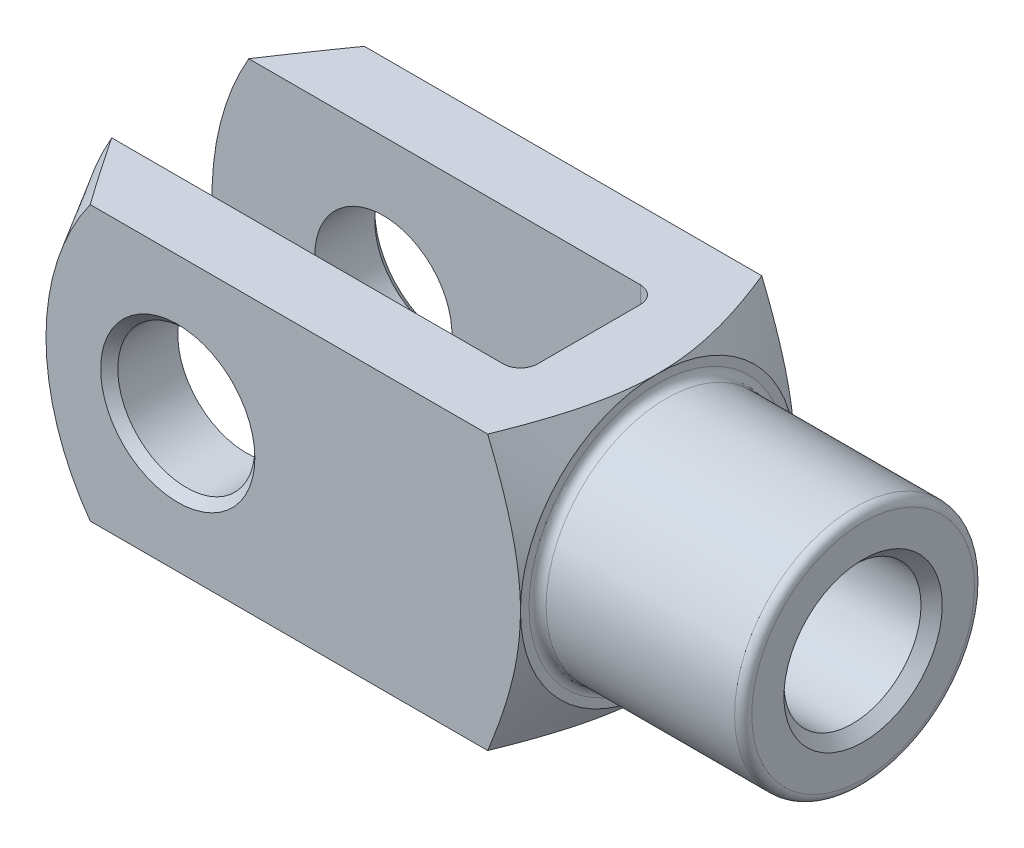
ISO-10303-21;
HEADER;
FILE_DESCRIPTION(('STEP AP214'),'2;1');
FILE_NAME('part.step','',(''),(''),'','','');
FILE_SCHEMA(('AUTOMOTIVE_DESIGN { 1 0 10303 214 1 1 1 1 }'));
ENDSEC;
DATA;
#1=APPLICATION_CONTEXT('core data for automotive mechanical design processes');
#2=APPLICATION_PROTOCOL_DEFINITION('international standard','automotive_design',2000,#1);
#3=PRODUCT_CONTEXT('',#1,'mechanical');
#4=PRODUCT('Part','Part','',(#3));
#5=PRODUCT_RELATED_PRODUCT_CATEGORY('part','',(#4));
#6=PRODUCT_DEFINITION_FORMATION('','',#4);
#7=PRODUCT_DEFINITION_CONTEXT('part definition',#1,'design');
#8=PRODUCT_DEFINITION('design','',#6,#7);
#9=PRODUCT_DEFINITION_SHAPE('','',#8);
#10=(LENGTH_UNIT() NAMED_UNIT(*) SI_UNIT(.MILLI.,.METRE.));
#11=(NAMED_UNIT(*) PLANE_ANGLE_UNIT() SI_UNIT($,.RADIAN.));
#12=(NAMED_UNIT(*) SI_UNIT($,.STERADIAN.) SOLID_ANGLE_UNIT());
#13=UNCERTAINTY_MEASURE_WITH_UNIT(LENGTH_MEASURE(1.E-05),#10,'distance_accuracy_value','');
#14=(GEOMETRIC_REPRESENTATION_CONTEXT(3) GLOBAL_UNCERTAINTY_ASSIGNED_CONTEXT((#13)) GLOBAL_UNIT_ASSIGNED_CONTEXT((#10,
#11,#12)) REPRESENTATION_CONTEXT('',''));
#15=CARTESIAN_POINT('',(0.,0.,0.));
#16=DIRECTION('',(0.,0.,1.));
#17=DIRECTION('',(1.,0.,0.));
#18=AXIS2_PLACEMENT_3D('',#15,#16,#17);
#19=CARTESIAN_POINT('',(-17.,-8.,-2.99999999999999));
#20=DIRECTION('',(0.,-1.,0.));
#21=DIRECTION('',(0.,0.,-1.));
#22=AXIS2_PLACEMENT_3D('',#19,#20,#21);
#23=CYLINDRICAL_SURFACE('',#22,1.);
#24=DIRECTION('',(0.,1.,0.));
#25=VECTOR('',#24,1.);
#26=CARTESIAN_POINT('',(-16.,-8.,-2.99999999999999));
#27=LINE('',#26,#25);
#28=CARTESIAN_POINT('',(-16.,-2.6457513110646,-2.99999999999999));
#29=VERTEX_POINT('',#28);
#30=CARTESIAN_POINT('',(-16.,-8.,-2.99999999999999));
#31=VERTEX_POINT('',#30);
#32=EDGE_CURVE('E359',#29,#31,#27,.F.);
#33=ORIENTED_EDGE('',*,*,#32,.F.);
#34=CARTESIAN_POINT('',(-16.,-2.64575131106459,-2.99999999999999));
#35=CARTESIAN_POINT('',(-16.0000222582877,-2.59691643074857,-3.04308129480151));
#36=CARTESIAN_POINT('',(-16.0027813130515,-2.54706628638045,-3.08491225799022));
#37=CARTESIAN_POINT('',(-16.012996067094,-2.44577843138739,-3.16580783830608));
#38=CARTESIAN_POINT('',(-16.0204427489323,-2.39434394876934,-3.2048776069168));
#39=CARTESIAN_POINT('',(-16.0391856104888,-2.29056221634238,-3.27984708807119));
#40=CARTESIAN_POINT('',(-16.0504501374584,-2.23822572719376,-3.31576990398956));
#41=CARTESIAN_POINT('',(-16.0762500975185,-2.13245420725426,-3.38476417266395));
#42=CARTESIAN_POINT('',(-16.0907876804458,-2.07901847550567,-3.41783373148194));
#43=CARTESIAN_POINT('',(-16.1314716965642,-1.94128133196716,-3.49869690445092));
#44=CARTESIAN_POINT('',(-16.159576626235,-1.85634962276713,-3.54444475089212));
#45=CARTESIAN_POINT('',(-16.2208922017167,-1.68494910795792,-3.62906229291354));
#46=CARTESIAN_POINT('',(-16.2541046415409,-1.59847977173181,-3.66792956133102));
#47=CARTESIAN_POINT('',(-16.3598954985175,-1.33652816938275,-3.77483346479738));
#48=CARTESIAN_POINT('',(-16.4383939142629,-1.1592254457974,-3.83275455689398));
#49=CARTESIAN_POINT('',(-16.5956023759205,-0.820227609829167,-3.91850936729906));
#50=CARTESIAN_POINT('',(-16.6735122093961,-0.658737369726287,-3.948765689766));
#51=CARTESIAN_POINT('',(-16.8324153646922,-0.335223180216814,-3.98924683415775));
#52=CARTESIAN_POINT('',(-16.9133996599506,-0.173201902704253,-3.99952627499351));
#53=CARTESIAN_POINT('',(-16.9962288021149,-0.00754240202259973,-3.99999466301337));
#54=CARTESIAN_POINT('',(-16.9981144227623,-0.00377116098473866,-3.99999999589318));
#55=CARTESIAN_POINT('',(-17.,0.,-4.));
#56=B_SPLINE_CURVE_WITH_KNOTS('',3,(#34,#35,#36,#37,#38,#39,#40,#41,#42,#43,#44,#45,#46,#47,#48,
#49,#50,#51,#52,#53,#54,#55),.UNSPECIFIED.,.F.,.F.,(4,2,2,2,2,2,2,2,2,2,4),(0.,
0.195194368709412,0.390014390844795,0.583257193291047,0.776627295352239,1.0775931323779,
1.37866492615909,1.98338003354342,2.52784959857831,3.07082842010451,3.08347754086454),.UNSPECIFIED.);
#57=CARTESIAN_POINT('',(-17.,0.,-4.));
#58=VERTEX_POINT('',#57);
#59=EDGE_CURVE('E390',#29,#58,#56,.T.);
#60=ORIENTED_EDGE('',*,*,#59,.T.);
#61=DIRECTION('',(0.,1.,0.));
#62=VECTOR('',#61,1.);
#63=CARTESIAN_POINT('',(-17.,8.,-3.99999999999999));
#64=LINE('',#63,#62);
#65=CARTESIAN_POINT('',(-17.,-8.,-3.99999999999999));
#66=VERTEX_POINT('',#65);
#67=EDGE_CURVE('E183',#66,#58,#64,.T.);
#68=ORIENTED_EDGE('',*,*,#67,.F.);
#69=CARTESIAN_POINT('',(-17.,-8.,-2.99999999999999));
#70=DIRECTION('',(0.,-1.,0.));
#71=DIRECTION('',(0.,0.,-1.));
#72=AXIS2_PLACEMENT_3D('',#69,#70,#71);
#73=CIRCLE('',#72,1.);
#74=EDGE_CURVE('E198',#31,#66,#73,.F.);
#75=ORIENTED_EDGE('',*,*,#74,.F.);
#76=EDGE_LOOP('',(#33,#60,#68,#75));
#77=FACE_BOUND('',#76,.T.);
#78=ADVANCED_FACE('F37',(#77),#23,.F.);
#79=CARTESIAN_POINT('',(-16.,-8.,-3.99999999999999));
#80=DIRECTION('',(1.,0.,0.));
#81=DIRECTION('',(0.,0.,-1.));
#82=AXIS2_PLACEMENT_3D('',#79,#80,#81);
#83=PLANE('',#82);
#84=CARTESIAN_POINT('',(-16.,8.,-2.99999999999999));
#85=VERTEX_POINT('',#84);
#86=CARTESIAN_POINT('',(-16.,2.6457513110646,-2.99999999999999));
#87=VERTEX_POINT('',#86);
#88=EDGE_CURVE('E375',#85,#87,#27,.F.);
#89=ORIENTED_EDGE('',*,*,#88,.T.);
#90=CARTESIAN_POINT('',(-16.,0.,0.));
#91=DIRECTION('',(1.,0.,0.));
#92=DIRECTION('',(0.,0.,-1.));
#93=AXIS2_PLACEMENT_3D('',#90,#91,#92);
#94=CIRCLE('',#93,4.);
#95=CARTESIAN_POINT('',(-16.,2.64575131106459,3.));
#96=VERTEX_POINT('',#95);
#97=EDGE_CURVE('E741',#87,#96,#94,.T.);
#98=ORIENTED_EDGE('',*,*,#97,.T.);
#99=DIRECTION('',(0.,1.,0.));
#100=VECTOR('',#99,1.);
#101=CARTESIAN_POINT('',(-16.,8.,3.));
#102=LINE('',#101,#100);
#103=CARTESIAN_POINT('',(-16.,8.,3.));
#104=VERTEX_POINT('',#103);
#105=EDGE_CURVE('E160',#96,#104,#102,.T.);
#106=ORIENTED_EDGE('',*,*,#105,.T.);
#107=DIRECTION('',(0.,0.,-1.));
#108=VECTOR('',#107,1.);
#109=CARTESIAN_POINT('',(-16.,8.,-3.99999999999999));
#110=LINE('',#109,#108);
#111=EDGE_CURVE('E339',#104,#85,#110,.T.);
#112=ORIENTED_EDGE('',*,*,#111,.T.);
#113=EDGE_LOOP('',(#89,#98,#106,#112));
#114=FACE_BOUND('',#113,.T.);
#115=ADVANCED_FACE('F463',(#114),#83,.F.);
#116=CARTESIAN_POINT('',(-17.,-8.,3.));
#117=DIRECTION('',(0.,-1.,0.));
#118=DIRECTION('',(0.,0.,-1.));
#119=AXIS2_PLACEMENT_3D('',#116,#117,#118);
#120=CYLINDRICAL_SURFACE('',#119,1.);
#121=ORIENTED_EDGE('',*,*,#105,.F.);
#122=CARTESIAN_POINT('',(-16.,2.64575131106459,3.));
#123=CARTESIAN_POINT('',(-16.0000222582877,2.59691643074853,3.04308129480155));
#124=CARTESIAN_POINT('',(-16.0027813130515,2.54706628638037,3.08491225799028));
#125=CARTESIAN_POINT('',(-16.012996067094,2.44577843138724,3.1658078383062));
#126=CARTESIAN_POINT('',(-16.0204427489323,2.39434394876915,3.20487760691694));
#127=CARTESIAN_POINT('',(-16.0391856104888,2.29056221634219,3.27984708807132));
#128=CARTESIAN_POINT('',(-16.0504501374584,2.23822572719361,3.31576990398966));
#129=CARTESIAN_POINT('',(-16.0762500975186,2.13245420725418,3.384764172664));
#130=CARTESIAN_POINT('',(-16.0907876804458,2.07901847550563,3.41783373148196));
#131=CARTESIAN_POINT('',(-16.1314716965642,1.94128133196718,3.49869690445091));
#132=CARTESIAN_POINT('',(-16.1595766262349,1.85634962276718,3.54444475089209));
#133=CARTESIAN_POINT('',(-16.2208922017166,1.68494910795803,3.62906229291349));
#134=CARTESIAN_POINT('',(-16.2541046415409,1.59847977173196,3.66792956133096));
#135=CARTESIAN_POINT('',(-16.3598954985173,1.33652816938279,3.77483346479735));
#136=CARTESIAN_POINT('',(-16.4383939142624,1.15922544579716,3.83275455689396));
#137=CARTESIAN_POINT('',(-16.595602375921,0.820227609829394,3.91850936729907));
#138=CARTESIAN_POINT('',(-16.673512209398,0.658737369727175,3.94876568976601));
#139=CARTESIAN_POINT('',(-16.8324153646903,0.335223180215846,3.98924683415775));
#140=CARTESIAN_POINT('',(-16.9133996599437,0.173201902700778,3.9995262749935));
#141=CARTESIAN_POINT('',(-16.9962288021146,0.00754240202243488,3.99999466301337));
#142=CARTESIAN_POINT('',(-16.9981144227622,0.00377116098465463,3.99999999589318));
#143=CARTESIAN_POINT('',(-17.,0.,4.));
#144=B_SPLINE_CURVE_WITH_KNOTS('',3,(#122,#123,#124,#125,#126,#127,#128,#129,#130,#131,#132,
#133,#134,#135,#136,#137,#138,#139,#140,#141,#142,#143),.UNSPECIFIED.,.F.,.F.,(4,2,2,2,2,2,2,2,
2,2,4),(0.,0.195194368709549,0.390014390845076,0.583257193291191,0.776627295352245,
1.0775931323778,1.37866492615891,1.98338003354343,2.52784959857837,3.07082842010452,
3.08347754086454),.UNSPECIFIED.);
#145=CARTESIAN_POINT('',(-17.,0.,4.));
#146=VERTEX_POINT('',#145);
#147=EDGE_CURVE('E145',#96,#146,#144,.T.);
#148=ORIENTED_EDGE('',*,*,#147,.T.);
#149=DIRECTION('',(0.,1.,0.));
#150=VECTOR('',#149,1.);
#151=CARTESIAN_POINT('',(-17.,-8.,4.));
#152=LINE('',#151,#150);
#153=CARTESIAN_POINT('',(-17.,8.,4.));
#154=VERTEX_POINT('',#153);
#155=EDGE_CURVE('E159',#154,#146,#152,.F.);
#156=ORIENTED_EDGE('',*,*,#155,.F.);
#157=CARTESIAN_POINT('',(-17.,8.,3.));
#158=DIRECTION('',(0.,1.,0.));
#159=DIRECTION('',(0.,0.,1.));
#160=AXIS2_PLACEMENT_3D('',#157,#158,#159);
#161=CIRCLE('',#160,1.);
#162=EDGE_CURVE('E190',#104,#154,#161,.F.);
#163=ORIENTED_EDGE('',*,*,#162,.F.);
#164=EDGE_LOOP('',(#121,#148,#156,#163));
#165=FACE_BOUND('',#164,.T.);
#166=ADVANCED_FACE('F156',(#165),#120,.F.);
#167=CARTESIAN_POINT('',(-42.,-8.,-3.99999999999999));
#168=DIRECTION('',(0.,0.,-1.));
#169=DIRECTION('',(-1.,0.,0.));
#170=AXIS2_PLACEMENT_3D('',#167,#168,#169);
#171=PLANE('',#170);
#172=CARTESIAN_POINT('',(-32.,0.,-3.99999999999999));
#173=DIRECTION('',(0.,0.,-1.));
#174=DIRECTION('',(-1.,0.,0.));
#175=AXIS2_PLACEMENT_3D('',#172,#173,#174);
#176=CIRCLE('',#175,4.);
#177=CARTESIAN_POINT('',(-36.,0.,-3.99999999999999));
#178=VERTEX_POINT('',#177);
#179=EDGE_CURVE('E369',#178,#178,#176,.F.);
#180=ORIENTED_EDGE('',*,*,#179,.F.);
#181=EDGE_LOOP('',(#180));
#182=FACE_BOUND('',#181,.T.);
#183=CARTESIAN_POINT('',(-26.,0.,-3.99999999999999));
#184=DIRECTION('',(0.,0.,1.));
#185=DIRECTION('',(1.,0.,0.));
#186=AXIS2_PLACEMENT_3D('',#183,#184,#185);
#187=CIRCLE('',#186,16.);
#188=CARTESIAN_POINT('',(-39.856406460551,8.,-3.99999999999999));
#189=VERTEX_POINT('',#188);
#190=CARTESIAN_POINT('',(-39.856406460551,-8.,-3.99999999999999));
#191=VERTEX_POINT('',#190);
#192=EDGE_CURVE('E277',#189,#191,#187,.T.);
#193=ORIENTED_EDGE('',*,*,#192,.T.);
#194=DIRECTION('',(-1.,0.,0.));
#195=VECTOR('',#194,1.);
#196=CARTESIAN_POINT('',(-42.,-8.,-3.99999999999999));
#197=LINE('',#196,#195);
#198=EDGE_CURVE('E334',#66,#191,#197,.T.);
#199=ORIENTED_EDGE('',*,*,#198,.F.);
#200=ORIENTED_EDGE('',*,*,#67,.T.);
#201=CARTESIAN_POINT('',(-17.,8.,-3.99999999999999));
#202=VERTEX_POINT('',#201);
#203=EDGE_CURVE('E179',#58,#202,#64,.T.);
#204=ORIENTED_EDGE('',*,*,#203,.T.);
#205=DIRECTION('',(-1.,0.,0.));
#206=VECTOR('',#205,1.);
#207=CARTESIAN_POINT('',(-42.,8.,-3.99999999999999));
#208=LINE('',#207,#206);
#209=EDGE_CURVE('E347',#202,#189,#208,.T.);
#210=ORIENTED_EDGE('',*,*,#209,.T.);
#211=EDGE_LOOP('',(#193,#199,#200,#204,#210));
#212=FACE_BOUND('',#211,.T.);
#213=ADVANCED_FACE('F393',(#182,#212),#171,.F.);
#214=CARTESIAN_POINT('',(-42.,-8.,4.00000000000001));
#215=DIRECTION('',(0.,0.,1.));
#216=DIRECTION('',(1.,0.,0.));
#217=AXIS2_PLACEMENT_3D('',#214,#215,#216);
#218=PLANE('',#217);
#219=CARTESIAN_POINT('',(-32.,0.,4.));
#220=DIRECTION('',(0.,0.,1.));
#221=DIRECTION('',(1.,0.,0.));
#222=AXIS2_PLACEMENT_3D('',#219,#220,#221);
#223=CIRCLE('',#222,4.);
#224=CARTESIAN_POINT('',(-28.,0.,4.));
#225=VERTEX_POINT('',#224);
#226=EDGE_CURVE('E346',#225,#225,#223,.F.);
#227=ORIENTED_EDGE('',*,*,#226,.F.);
#228=EDGE_LOOP('',(#227));
#229=FACE_BOUND('',#228,.T.);
#230=DIRECTION('',(1.,0.,0.));
#231=VECTOR('',#230,1.);
#232=CARTESIAN_POINT('',(-42.,-8.,4.00000000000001));
#233=LINE('',#232,#231);
#234=CARTESIAN_POINT('',(-39.856406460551,-8.,4.00000000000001));
#235=VERTEX_POINT('',#234);
#236=CARTESIAN_POINT('',(-17.,-8.,4.));
#237=VERTEX_POINT('',#236);
#238=EDGE_CURVE('E338',#235,#237,#233,.T.);
#239=ORIENTED_EDGE('',*,*,#238,.F.);
#240=CARTESIAN_POINT('',(-26.,0.,4.00000000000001));
#241=DIRECTION('',(0.,0.,1.));
#242=DIRECTION('',(1.,0.,0.));
#243=AXIS2_PLACEMENT_3D('',#240,#241,#242);
#244=CIRCLE('',#243,16.);
#245=CARTESIAN_POINT('',(-39.856406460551,8.,4.00000000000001));
#246=VERTEX_POINT('',#245);
#247=EDGE_CURVE('E414',#246,#235,#244,.T.);
#248=ORIENTED_EDGE('',*,*,#247,.F.);
#249=DIRECTION('',(1.,0.,0.));
#250=VECTOR('',#249,1.);
#251=CARTESIAN_POINT('',(-42.,8.,4.00000000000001));
#252=LINE('',#251,#250);
#253=EDGE_CURVE('E176',#246,#154,#252,.T.);
#254=ORIENTED_EDGE('',*,*,#253,.T.);
#255=ORIENTED_EDGE('',*,*,#155,.T.);
#256=EDGE_CURVE('E164',#146,#237,#152,.F.);
#257=ORIENTED_EDGE('',*,*,#256,.T.);
#258=EDGE_LOOP('',(#239,#248,#254,#255,#257));
#259=FACE_BOUND('',#258,.T.);
#260=ADVANCED_FACE('F173',(#229,#259),#218,.F.);
#261=CARTESIAN_POINT('',(-42.,-8.,8.));
#262=DIRECTION('',(0.,0.,1.));
#263=DIRECTION('',(1.,0.,0.));
#264=AXIS2_PLACEMENT_3D('',#261,#262,#263);
#265=PLANE('',#264);
#266=CARTESIAN_POINT('',(-32.,0.,8.));
#267=DIRECTION('',(0.,0.,1.));
#268=DIRECTION('',(1.,0.,0.));
#269=AXIS2_PLACEMENT_3D('',#266,#267,#268);
#270=CIRCLE('',#269,4.49999999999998);
#271=CARTESIAN_POINT('',(-27.5,0.,8.));
#272=VERTEX_POINT('',#271);
#273=EDGE_CURVE('E229',#272,#272,#270,.F.);
#274=ORIENTED_EDGE('',*,*,#273,.T.);
#275=EDGE_LOOP('',(#274));
#276=FACE_BOUND('',#275,.T.);
#277=DIRECTION('',(1.,0.,0.));
#278=VECTOR('',#277,1.);
#279=CARTESIAN_POINT('',(-42.,8.,8.));
#280=LINE('',#279,#278);
#281=CARTESIAN_POINT('',(-37.1100179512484,8.,8.));
#282=VERTEX_POINT('',#281);
#283=CARTESIAN_POINT('',(-13.9131704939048,8.,8.));
#284=VERTEX_POINT('',#283);
#285=EDGE_CURVE('E366',#282,#284,#280,.T.);
#286=ORIENTED_EDGE('',*,*,#285,.F.);
#287=CARTESIAN_POINT('',(-26.,0.,8.));
#288=DIRECTION('',(0.,0.,1.));
#289=DIRECTION('',(1.,0.,0.));
#290=AXIS2_PLACEMENT_3D('',#287,#288,#289);
#291=CIRCLE('',#290,13.6905989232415);
#292=CARTESIAN_POINT('',(-37.1100179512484,-8.,8.));
#293=VERTEX_POINT('',#292);
#294=EDGE_CURVE('E61',#282,#293,#291,.T.);
#295=ORIENTED_EDGE('',*,*,#294,.T.);
#296=DIRECTION('',(1.,0.,0.));
#297=VECTOR('',#296,1.);
#298=CARTESIAN_POINT('',(-42.,-8.,8.));
#299=LINE('',#298,#297);
#300=CARTESIAN_POINT('',(-13.9131704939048,-8.,8.));
#301=VERTEX_POINT('',#300);
#302=EDGE_CURVE('E363',#293,#301,#299,.T.);
#303=ORIENTED_EDGE('',*,*,#302,.T.);
#304=CARTESIAN_POINT('',(-17.8846987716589,-16.3392348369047,8.));
#305=CARTESIAN_POINT('',(-17.6802772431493,-15.9449469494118,8.));
#306=CARTESIAN_POINT('',(-17.4769364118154,-15.550093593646,8.));
#307=CARTESIAN_POINT('',(-17.0729892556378,-14.7589649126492,8.));
#308=CARTESIAN_POINT('',(-16.8723830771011,-14.3626895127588,8.));
#309=CARTESIAN_POINT('',(-16.474153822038,-13.56777616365,8.));
#310=CARTESIAN_POINT('',(-16.2765365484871,-13.1691353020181,8.));
#311=CARTESIAN_POINT('',(-15.88546114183,-12.3698241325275,8.));
#312=CARTESIAN_POINT('',(-15.6920029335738,-11.9691538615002,8.));
#313=CARTESIAN_POINT('',(-15.2985635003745,-11.1406012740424,8.));
#314=CARTESIAN_POINT('',(-15.0989132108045,-10.7125613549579,8.));
#315=CARTESIAN_POINT('',(-14.7072115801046,-9.85297670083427,8.));
#316=CARTESIAN_POINT('',(-14.5151606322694,-9.42143178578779,8.));
#317=CARTESIAN_POINT('',(-14.1411578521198,-8.55419814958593,8.));
#318=CARTESIAN_POINT('',(-13.959201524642,-8.11851137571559,8.));
#319=CARTESIAN_POINT('',(-13.6086480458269,-7.24179288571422,8.));
#320=CARTESIAN_POINT('',(-13.4400493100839,-6.80076181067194,8.));
#321=CARTESIAN_POINT('',(-13.1834024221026,-6.08615976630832,8.));
#322=CARTESIAN_POINT('',(-13.0896630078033,-5.81463561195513,8.));
#323=CARTESIAN_POINT('',(-12.9102546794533,-5.2689424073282,8.));
#324=CARTESIAN_POINT('',(-12.8245850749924,-4.99477358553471,8.));
#325=CARTESIAN_POINT('',(-12.6629013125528,-4.44359021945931,8.));
#326=CARTESIAN_POINT('',(-12.5868869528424,-4.16657573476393,8.));
#327=CARTESIAN_POINT('',(-12.4463305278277,-3.60962774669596,8.));
#328=CARTESIAN_POINT('',(-12.3817883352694,-3.32969427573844,8.));
#329=CARTESIAN_POINT('',(-12.267479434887,-2.77364565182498,8.));
#330=CARTESIAN_POINT('',(-12.2174014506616,-2.49759512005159,8.));
#331=CARTESIAN_POINT('',(-12.1318063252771,-1.94322662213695,8.));
#332=CARTESIAN_POINT('',(-12.0962887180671,-1.66490872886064,8.));
#333=CARTESIAN_POINT('',(-12.0412989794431,-1.10685523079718,8.));
#334=CARTESIAN_POINT('',(-12.0218163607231,-0.827120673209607,8.));
#335=CARTESIAN_POINT('',(-11.9997560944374,-0.266983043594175,8.));
#336=CARTESIAN_POINT('',(-11.9971778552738,0.013420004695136,8.));
#337=CARTESIAN_POINT('',(-12.0086102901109,0.553432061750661,8.));
#338=CARTESIAN_POINT('',(-12.0214258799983,0.813067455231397,8.));
#339=CARTESIAN_POINT('',(-12.0611642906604,1.3312448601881,8.));
#340=CARTESIAN_POINT('',(-12.0880870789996,1.5897868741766,8.));
#341=CARTESIAN_POINT('',(-12.155052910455,2.10528244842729,8.));
#342=CARTESIAN_POINT('',(-12.195102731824,2.36223511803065,8.));
#343=CARTESIAN_POINT('',(-12.2870021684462,2.87400792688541,8.));
#344=CARTESIAN_POINT('',(-12.3388521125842,3.12882800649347,8.));
#345=CARTESIAN_POINT('',(-12.4545600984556,3.6434629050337,8.));
#346=CARTESIAN_POINT('',(-12.518722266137,3.90320881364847,8.));
#347=CARTESIAN_POINT('',(-12.6564654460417,4.42017468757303,8.));
#348=CARTESIAN_POINT('',(-12.7300465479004,4.67739462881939,8.));
#349=CARTESIAN_POINT('',(-12.8852035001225,5.18938513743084,8.));
#350=CARTESIAN_POINT('',(-12.9667789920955,5.44415581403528,8.));
#351=CARTESIAN_POINT('',(-13.1366771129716,5.95141147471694,8.));
#352=CARTESIAN_POINT('',(-13.224999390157,6.20389657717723,8.));
#353=CARTESIAN_POINT('',(-13.4147611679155,6.7272922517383,8.));
#354=CARTESIAN_POINT('',(-13.5166830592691,6.99802735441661,8.));
#355=CARTESIAN_POINT('',(-13.7260618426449,7.53735530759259,8.));
#356=CARTESIAN_POINT('',(-13.8335190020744,7.80594805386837,8.));
#357=CARTESIAN_POINT('',(-14.0530704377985,8.34129271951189,8.));
#358=CARTESIAN_POINT('',(-14.1651656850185,8.60804423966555,8.));
#359=CARTESIAN_POINT('',(-14.3932328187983,9.13988748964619,8.));
#360=CARTESIAN_POINT('',(-14.5092047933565,9.40497918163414,8.));
#361=CARTESIAN_POINT('',(-14.8621889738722,10.1985259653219,8.));
#362=CARTESIAN_POINT('',(-15.1040848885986,10.7248088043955,8.));
#363=CARTESIAN_POINT('',(-15.5972155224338,11.7728810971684,8.));
#364=CARTESIAN_POINT('',(-15.8484492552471,12.2946710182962,8.));
#365=CARTESIAN_POINT('',(-16.3586491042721,13.3364224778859,8.));
#366=CARTESIAN_POINT('',(-16.6176364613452,13.8563735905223,8.));
#367=CARTESIAN_POINT('',(-17.1409123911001,14.8936090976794,8.));
#368=CARTESIAN_POINT('',(-17.4052010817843,15.4108934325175,8.));
#369=CARTESIAN_POINT('',(-17.9377393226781,16.4430931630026,8.));
#370=CARTESIAN_POINT('',(-18.2059868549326,16.9580096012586,8.));
#371=CARTESIAN_POINT('',(-18.7457004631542,17.9861456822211,8.));
#372=CARTESIAN_POINT('',(-19.0171665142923,18.4993653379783,8.));
#373=CARTESIAN_POINT('',(-19.754394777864,19.8847467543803,8.));
#374=CARTESIAN_POINT('',(-20.2225895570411,20.7556134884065,8.));
#375=CARTESIAN_POINT('',(-21.164259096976,22.494640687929,8.));
#376=CARTESIAN_POINT('',(-21.6377345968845,23.3628007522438,8.));
#377=CARTESIAN_POINT('',(-22.5857843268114,25.0920581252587,8.));
#378=CARTESIAN_POINT('',(-23.0603367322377,25.9531674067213,8.));
#379=CARTESIAN_POINT('',(-23.7742624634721,27.2435811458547,8.));
#380=CARTESIAN_POINT('',(-24.0125683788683,27.6734768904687,8.));
#381=CARTESIAN_POINT('',(-24.4898082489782,28.5329190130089,8.));
#382=CARTESIAN_POINT('',(-24.7287422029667,28.9624653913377,8.));
#383=CARTESIAN_POINT('',(-24.9679488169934,29.3918599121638,8.));
#384=B_SPLINE_CURVE_WITH_KNOTS('',3,(#304,#305,#306,#307,#308,#309,#310,#311,#312,#313,#314,
#315,#316,#317,#318,#319,#320,#321,#322,#323,#324,#325,#326,#327,#328,#329,#330,#331,#332,#333,
#334,#335,#336,#337,#338,#339,#340,#341,#342,#343,#344,#345,#346,#347,#348,#349,#350,#351,#352,
#353,#354,#355,#356,#357,#358,#359,#360,#361,#362,#363,#364,#365,#366,#367,#368,#369,#370,#371,
#372,#373,#374,#375,#376,#377,#378,#379,#380,#381,#382,#383),.UNSPECIFIED.,.F.,.F.,(4,2,2,2,2,2,
2,2,2,2,2,2,2,2,2,2,2,2,2,2,2,2,2,2,2,2,2,2,2,2,2,2,2,2,2,2,2,2,2,4),(0.,1.33239397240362,
2.66485895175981,3.99964423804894,5.33440538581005,6.7512847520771,8.16823735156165,
9.58455382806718,11.0007020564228,11.8623516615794,12.7239274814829,13.5854852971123,
14.4470335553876,15.2883577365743,16.1296549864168,16.9704015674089,17.8111187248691,
18.590575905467,19.3700312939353,20.1498897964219,20.9297700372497,21.732223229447,
22.5346840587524,23.3371089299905,24.139491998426,25.0072719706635,25.8750939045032,
26.7430984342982,27.6111226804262,29.3486130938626,31.085920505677,32.8285250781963,
34.5711684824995,36.3129523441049,38.0547227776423,41.0209268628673,43.9875514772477,
46.9371849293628,48.4117694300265,49.8863522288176),.UNSPECIFIED.);
#385=CARTESIAN_POINT('',(-12.,0.,8.));
#386=VERTEX_POINT('',#385);
#387=EDGE_CURVE('E306',#386,#301,#384,.F.);
#388=ORIENTED_EDGE('',*,*,#387,.F.);
#389=EDGE_CURVE('E304',#284,#386,#384,.F.);
#390=ORIENTED_EDGE('',*,*,#389,.F.);
#391=EDGE_LOOP('',(#286,#295,#303,#388,#390));
#392=FACE_BOUND('',#391,.T.);
#393=ADVANCED_FACE('F288',(#276,#392),#265,.T.);
#394=CARTESIAN_POINT('',(-42.,-8.,8.));
#395=DIRECTION('',(0.,-1.,0.));
#396=DIRECTION('',(0.,0.,-1.));
#397=AXIS2_PLACEMENT_3D('',#394,#395,#396);
#398=PLANE('',#397);
#399=ORIENTED_EDGE('',*,*,#198,.T.);
#400=CARTESIAN_POINT('',(-46.1857767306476,-8.,5.89565350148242));
#401=CARTESIAN_POINT('',(-45.7965292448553,-8.,5.2689297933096));
#402=CARTESIAN_POINT('',(-45.4062157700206,-8.,4.64286516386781));
#403=CARTESIAN_POINT('',(-44.6229580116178,-8.,3.39236663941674));
#404=CARTESIAN_POINT('',(-44.2300136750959,-8.,2.76793277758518));
#405=CARTESIAN_POINT('',(-43.4405400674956,-8.,1.52028939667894));
#406=CARTESIAN_POINT('',(-43.0440070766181,-8.,0.897082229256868));
#407=CARTESIAN_POINT('',(-42.2471530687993,-8.,-0.346899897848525));
#408=CARTESIAN_POINT('',(-41.8468320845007,-8.,-0.967674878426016));
#409=CARTESIAN_POINT('',(-41.0247666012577,-8.,-2.23198790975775));
#410=CARTESIAN_POINT('',(-40.6028241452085,-8.,-2.87539744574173));
#411=CARTESIAN_POINT('',(-39.7525673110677,-8.,-4.15798891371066));
#412=CARTESIAN_POINT('',(-39.3242529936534,-8.,-4.79717088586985));
#413=CARTESIAN_POINT('',(-38.4597392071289,-8.,-6.06950936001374));
#414=CARTESIAN_POINT('',(-38.0235458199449,-8.,-6.70266997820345));
#415=CARTESIAN_POINT('',(-37.3611233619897,-8.,-7.64668569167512));
#416=CARTESIAN_POINT('',(-37.1389647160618,-8.,-7.96039757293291));
#417=CARTESIAN_POINT('',(-36.6914753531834,-8.,-8.58554886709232));
#418=CARTESIAN_POINT('',(-36.4661446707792,-8.,-8.89698830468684));
#419=CARTESIAN_POINT('',(-36.0138777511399,-8.,-9.51426261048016));
#420=CARTESIAN_POINT('',(-35.7869759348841,-8.,-9.82012266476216));
#421=CARTESIAN_POINT('',(-35.3288611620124,-8.,-10.4285917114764));
#422=CARTESIAN_POINT('',(-35.0976483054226,-8.,-10.7312007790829));
#423=CARTESIAN_POINT('',(-34.6297403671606,-8.,-11.3328374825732));
#424=CARTESIAN_POINT('',(-34.3930380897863,-8.,-11.6318595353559));
#425=CARTESIAN_POINT('',(-33.9133962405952,-8.,-12.2248466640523));
#426=CARTESIAN_POINT('',(-33.6704570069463,-8.,-12.5188120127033));
#427=CARTESIAN_POINT('',(-33.179485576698,-8.,-13.0972598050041));
#428=CARTESIAN_POINT('',(-32.9315323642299,-8.,-13.3818089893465));
#429=CARTESIAN_POINT('',(-32.426285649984,-8.,-13.9426547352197));
#430=CARTESIAN_POINT('',(-32.1689897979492,-8.,-14.2189491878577));
#431=CARTESIAN_POINT('',(-31.6433260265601,-8.,-14.7597258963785));
#432=CARTESIAN_POINT('',(-31.3749843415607,-8.,-15.0242333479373));
#433=CARTESIAN_POINT('',(-30.96154330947,-8.,-15.4091163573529));
#434=CARTESIAN_POINT('',(-30.8219428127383,-8.,-15.5354022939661));
#435=CARTESIAN_POINT('',(-30.5385996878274,-8.,-15.7832263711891));
#436=CARTESIAN_POINT('',(-30.3948575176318,-8.,-15.9047650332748));
#437=CARTESIAN_POINT('',(-30.0975226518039,-8.,-16.1463249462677));
#438=CARTESIAN_POINT('',(-29.943761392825,-8.,-16.2661397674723));
#439=CARTESIAN_POINT('',(-29.63058322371,-8.,-16.4982387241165));
#440=CARTESIAN_POINT('',(-29.4711652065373,-8.,-16.6105213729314));
#441=CARTESIAN_POINT('',(-29.1461892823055,-8.,-16.8256372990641));
#442=CARTESIAN_POINT('',(-28.980636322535,-8.,-16.9284779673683));
#443=CARTESIAN_POINT('',(-28.6428904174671,-8.,-17.12246219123));
#444=CARTESIAN_POINT('',(-28.4706992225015,-8.,-17.2136088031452));
#445=CARTESIAN_POINT('',(-28.0236575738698,-8.,-17.427073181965));
#446=CARTESIAN_POINT('',(-27.7438013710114,-8.,-17.539468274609));
#447=CARTESIAN_POINT('',(-27.3134448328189,-8.,-17.6730277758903));
#448=CARTESIAN_POINT('',(-27.1682897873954,-8.,-17.7117004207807));
#449=CARTESIAN_POINT('',(-26.8750748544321,-8.,-17.7760297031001));
#450=CARTESIAN_POINT('',(-26.7270150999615,-8.,-17.8016869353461));
#451=CARTESIAN_POINT('',(-26.4276254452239,-8.,-17.839058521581));
#452=CARTESIAN_POINT('',(-26.2762776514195,-8.,-17.8506309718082));
#453=CARTESIAN_POINT('',(-25.9731780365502,-8.,-17.8588139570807));
#454=CARTESIAN_POINT('',(-25.8214262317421,-8.,-17.8554250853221));
#455=CARTESIAN_POINT('',(-25.5189603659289,-8.,-17.8338479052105));
#456=CARTESIAN_POINT('',(-25.3682465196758,-8.,-17.8156566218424));
#457=CARTESIAN_POINT('',(-25.0691796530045,-8.,-17.765312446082));
#458=CARTESIAN_POINT('',(-24.9208270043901,-8.,-17.7331573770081));
#459=CARTESIAN_POINT('',(-24.6002883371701,-8.,-17.6490655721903));
#460=CARTESIAN_POINT('',(-24.4287768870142,-8.,-17.5945681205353));
#461=CARTESIAN_POINT('',(-24.0913326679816,-8.,-17.47036463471));
#462=CARTESIAN_POINT('',(-23.9254030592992,-8.,-17.400650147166));
#463=CARTESIAN_POINT('',(-23.5990125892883,-8.,-17.2483781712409));
#464=CARTESIAN_POINT('',(-23.4385691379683,-8.,-17.1657837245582));
#465=CARTESIAN_POINT('',(-23.12355142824,-8.,-16.9902060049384));
#466=CARTESIAN_POINT('',(-22.9689765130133,-8.,-16.897223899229));
#467=CARTESIAN_POINT('',(-22.6154702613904,-8.,-16.6708821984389));
#468=CARTESIAN_POINT('',(-22.4186208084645,-8.,-16.534282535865));
#469=CARTESIAN_POINT('',(-22.0333734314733,-8.,-16.2495879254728));
#470=CARTESIAN_POINT('',(-21.844979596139,-8.,-16.1014875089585));
#471=CARTESIAN_POINT('',(-21.4752188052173,-8.,-15.7961052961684));
#472=CARTESIAN_POINT('',(-21.2938660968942,-8.,-15.638806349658));
#473=CARTESIAN_POINT('',(-20.9375595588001,-8.,-15.3172162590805));
#474=CARTESIAN_POINT('',(-20.7626046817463,-8.,-15.1529262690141));
#475=CARTESIAN_POINT('',(-20.4170062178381,-8.,-14.8176183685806));
#476=CARTESIAN_POINT('',(-20.2463993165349,-8.,-14.6465627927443));
#477=CARTESIAN_POINT('',(-19.9099413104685,-8.,-14.2998402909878));
#478=CARTESIAN_POINT('',(-19.744090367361,-8.,-14.1241732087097));
#479=CARTESIAN_POINT('',(-19.4166747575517,-8.,-13.7692439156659));
#480=CARTESIAN_POINT('',(-19.2551057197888,-8.,-13.589985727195));
#481=CARTESIAN_POINT('',(-18.9355274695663,-8.,-13.2283206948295));
#482=CARTESIAN_POINT('',(-18.7775183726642,-8.,-13.045913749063));
#483=CARTESIAN_POINT('',(-18.3998299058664,-8.,-12.6023889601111));
#484=CARTESIAN_POINT('',(-18.1817025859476,-8.,-12.3399501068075));
#485=CARTESIAN_POINT('',(-17.7505813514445,-8.,-11.810817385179));
#486=CARTESIAN_POINT('',(-17.5375884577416,-8.,-11.5441226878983));
#487=CARTESIAN_POINT('',(-17.1191841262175,-8.,-11.0114334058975));
#488=CARTESIAN_POINT('',(-16.9137065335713,-8.,-10.7454906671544));
#489=CARTESIAN_POINT('',(-16.5064326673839,-8.,-10.2109265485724));
#490=CARTESIAN_POINT('',(-16.3046352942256,-8.,-9.94230600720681));
#491=CARTESIAN_POINT('',(-16.1043464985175,-8.,-9.67257983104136));
#492=B_SPLINE_CURVE_WITH_KNOTS('',3,(#400,#401,#402,#403,#404,#405,#406,#407,#408,#409,#410,
#411,#412,#413,#414,#415,#416,#417,#418,#419,#420,#421,#422,#423,#424,#425,#426,#427,#428,#429,
#430,#431,#432,#433,#434,#435,#436,#437,#438,#439,#440,#441,#442,#443,#444,#445,#446,#447,#448,
#449,#450,#451,#452,#453,#454,#455,#456,#457,#458,#459,#460,#461,#462,#463,#464,#465,#466,#467,
#468,#469,#470,#471,#472,#473,#474,#475,#476,#477,#478,#479,#480,#481,#482,#483,#484,#485,#486,
#487,#488,#489,#490,#491),.UNSPECIFIED.,.F.,.F.,(4,2,2,2,2,2,2,2,2,2,2,2,2,2,2,2,2,2,2,2,2,2,2,
2,2,2,2,2,2,2,2,2,2,2,2,2,2,2,2,2,2,2,2,2,2,4),(0.,2.21329571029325,4.42663610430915,
6.6426188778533,8.85858257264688,11.1668200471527,13.4750355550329,15.781539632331,
16.9347484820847,18.0879447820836,19.2304162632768,20.3728612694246,21.5168995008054,
22.6608758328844,23.7929840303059,24.9253790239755,26.0552243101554,26.619877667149,
27.184468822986,27.7690691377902,28.3537844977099,28.9380381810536,29.5221388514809,
30.4231831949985,30.873351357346,31.3234989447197,31.778145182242,32.2327733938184,
32.6874929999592,33.1422835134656,33.6813034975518,34.2206236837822,34.7615209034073,
35.3023574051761,36.0205977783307,36.7391817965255,37.4591511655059,38.1790021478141,
38.9036703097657,39.6283630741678,40.3522850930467,41.0762305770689,42.0999043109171,
43.1237799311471,44.1319728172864,45.1398593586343),.UNSPECIFIED.);
#493=CARTESIAN_POINT('',(-37.1100179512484,-8.,-8.));
#494=VERTEX_POINT('',#493);
#495=EDGE_CURVE('E276',#191,#494,#492,.T.);
#496=ORIENTED_EDGE('',*,*,#495,.T.);
#497=DIRECTION('',(1.,0.,0.));
#498=VECTOR('',#497,1.);
#499=CARTESIAN_POINT('',(-42.,-8.,-8.));
#500=LINE('',#499,#498);
#501=CARTESIAN_POINT('',(-13.9131704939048,-8.,-8.));
#502=VERTEX_POINT('',#501);
#503=EDGE_CURVE('E360',#494,#502,#500,.T.);
#504=ORIENTED_EDGE('',*,*,#503,.T.);
#505=CARTESIAN_POINT('',(-17.8846987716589,-8.,-16.3392348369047));
#506=CARTESIAN_POINT('',(-17.6802772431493,-8.,-15.9449469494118));
#507=CARTESIAN_POINT('',(-17.4769364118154,-8.,-15.550093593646));
#508=CARTESIAN_POINT('',(-17.0729892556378,-8.,-14.7589649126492));
#509=CARTESIAN_POINT('',(-16.8723830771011,-8.,-14.3626895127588));
#510=CARTESIAN_POINT('',(-16.474153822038,-8.,-13.56777616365));
#511=CARTESIAN_POINT('',(-16.2765365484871,-8.,-13.1691353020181));
#512=CARTESIAN_POINT('',(-15.88546114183,-8.,-12.3698241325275));
#513=CARTESIAN_POINT('',(-15.6920029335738,-8.,-11.9691538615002));
#514=CARTESIAN_POINT('',(-15.2985635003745,-8.,-11.1406012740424));
#515=CARTESIAN_POINT('',(-15.0989132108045,-8.,-10.7125613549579));
#516=CARTESIAN_POINT('',(-14.7072115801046,-8.,-9.85297670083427));
#517=CARTESIAN_POINT('',(-14.5151606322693,-8.,-9.42143178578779));
#518=CARTESIAN_POINT('',(-14.1411578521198,-8.,-8.55419814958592));
#519=CARTESIAN_POINT('',(-13.959201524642,-8.,-8.11851137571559));
#520=CARTESIAN_POINT('',(-13.6086480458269,-8.,-7.24179288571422));
#521=CARTESIAN_POINT('',(-13.4400493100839,-8.,-6.80076181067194));
#522=CARTESIAN_POINT('',(-13.1834024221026,-8.,-6.08615976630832));
#523=CARTESIAN_POINT('',(-13.0896630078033,-8.,-5.81463561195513));
#524=CARTESIAN_POINT('',(-12.9102546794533,-8.,-5.2689424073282));
#525=CARTESIAN_POINT('',(-12.8245850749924,-8.,-4.99477358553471));
#526=CARTESIAN_POINT('',(-12.6629013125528,-8.,-4.44359021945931));
#527=CARTESIAN_POINT('',(-12.5868869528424,-8.,-4.16657573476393));
#528=CARTESIAN_POINT('',(-12.4463305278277,-8.,-3.60962774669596));
#529=CARTESIAN_POINT('',(-12.3817883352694,-8.,-3.32969427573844));
#530=CARTESIAN_POINT('',(-12.267479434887,-8.,-2.77364565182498));
#531=CARTESIAN_POINT('',(-12.2174014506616,-8.,-2.49759512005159));
#532=CARTESIAN_POINT('',(-12.1318063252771,-8.,-1.94322662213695));
#533=CARTESIAN_POINT('',(-12.0962887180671,-8.,-1.66490872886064));
#534=CARTESIAN_POINT('',(-12.0412989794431,-8.,-1.10685523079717));
#535=CARTESIAN_POINT('',(-12.0218163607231,-8.,-0.827120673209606));
#536=CARTESIAN_POINT('',(-11.9997560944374,-8.,-0.266983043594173));
#537=CARTESIAN_POINT('',(-11.9971778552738,-8.,0.0134200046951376));
#538=CARTESIAN_POINT('',(-12.0086102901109,-8.,0.553432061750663));
#539=CARTESIAN_POINT('',(-12.0214258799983,-8.,0.813067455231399));
#540=CARTESIAN_POINT('',(-12.0611642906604,-8.,1.3312448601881));
#541=CARTESIAN_POINT('',(-12.0880870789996,-8.,1.58978687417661));
#542=CARTESIAN_POINT('',(-12.155052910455,-8.,2.10528244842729));
#543=CARTESIAN_POINT('',(-12.195102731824,-8.,2.36223511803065));
#544=CARTESIAN_POINT('',(-12.2870021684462,-8.,2.87400792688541));
#545=CARTESIAN_POINT('',(-12.3388521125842,-8.,3.12882800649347));
#546=CARTESIAN_POINT('',(-12.4545600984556,-8.,3.64346290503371));
#547=CARTESIAN_POINT('',(-12.518722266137,-8.,3.90320881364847));
#548=CARTESIAN_POINT('',(-12.6564654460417,-8.,4.42017468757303));
#549=CARTESIAN_POINT('',(-12.7300465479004,-8.,4.67739462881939));
#550=CARTESIAN_POINT('',(-12.8852035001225,-8.,5.18938513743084));
#551=CARTESIAN_POINT('',(-12.9667789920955,-8.,5.44415581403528));
#552=CARTESIAN_POINT('',(-13.1366771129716,-8.,5.95141147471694));
#553=CARTESIAN_POINT('',(-13.224999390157,-8.,6.20389657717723));
#554=CARTESIAN_POINT('',(-13.4147611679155,-8.,6.7272922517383));
#555=CARTESIAN_POINT('',(-13.5166830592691,-8.,6.99802735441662));
#556=CARTESIAN_POINT('',(-13.7260618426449,-8.,7.5373553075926));
#557=CARTESIAN_POINT('',(-13.8335190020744,-8.,7.80594805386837));
#558=CARTESIAN_POINT('',(-14.0530704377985,-8.,8.3412927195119));
#559=CARTESIAN_POINT('',(-14.1651656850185,-8.,8.60804423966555));
#560=CARTESIAN_POINT('',(-14.3932328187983,-8.,9.13988748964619));
#561=CARTESIAN_POINT('',(-14.5092047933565,-8.,9.40497918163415));
#562=CARTESIAN_POINT('',(-14.8621889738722,-8.,10.1985259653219));
#563=CARTESIAN_POINT('',(-15.1040848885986,-8.,10.7248088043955));
#564=CARTESIAN_POINT('',(-15.5972155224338,-8.,11.7728810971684));
#565=CARTESIAN_POINT('',(-15.8484492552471,-8.,12.2946710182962));
#566=CARTESIAN_POINT('',(-16.3586491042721,-8.,13.3364224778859));
#567=CARTESIAN_POINT('',(-16.6176364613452,-8.,13.8563735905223));
#568=CARTESIAN_POINT('',(-17.1409123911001,-8.,14.8936090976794));
#569=CARTESIAN_POINT('',(-17.4052010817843,-8.,15.4108934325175));
#570=CARTESIAN_POINT('',(-17.9377393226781,-8.,16.4430931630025));
#571=CARTESIAN_POINT('',(-18.2059868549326,-8.,16.9580096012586));
#572=CARTESIAN_POINT('',(-18.7457004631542,-8.,17.9861456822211));
#573=CARTESIAN_POINT('',(-19.0171665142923,-8.,18.4993653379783));
#574=CARTESIAN_POINT('',(-19.7543947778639,-8.,19.8847467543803));
#575=CARTESIAN_POINT('',(-20.2225895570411,-8.,20.7556134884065));
#576=CARTESIAN_POINT('',(-21.164259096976,-8.,22.494640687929));
#577=CARTESIAN_POINT('',(-21.6377345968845,-8.,23.3628007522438));
#578=CARTESIAN_POINT('',(-22.5857843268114,-8.,25.0920581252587));
#579=CARTESIAN_POINT('',(-23.0603367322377,-8.,25.9531674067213));
#580=CARTESIAN_POINT('',(-23.7742624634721,-8.,27.2435811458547));
#581=CARTESIAN_POINT('',(-24.0125683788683,-8.,27.6734768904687));
#582=CARTESIAN_POINT('',(-24.4898082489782,-8.,28.5329190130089));
#583=CARTESIAN_POINT('',(-24.7287422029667,-8.,28.9624653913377));
#584=CARTESIAN_POINT('',(-24.9679488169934,-8.,29.3918599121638));
#585=B_SPLINE_CURVE_WITH_KNOTS('',3,(#505,#506,#507,#508,#509,#510,#511,#512,#513,#514,#515,
#516,#517,#518,#519,#520,#521,#522,#523,#524,#525,#526,#527,#528,#529,#530,#531,#532,#533,#534,
#535,#536,#537,#538,#539,#540,#541,#542,#543,#544,#545,#546,#547,#548,#549,#550,#551,#552,#553,
#554,#555,#556,#557,#558,#559,#560,#561,#562,#563,#564,#565,#566,#567,#568,#569,#570,#571,#572,
#573,#574,#575,#576,#577,#578,#579,#580,#581,#582,#583,#584),.UNSPECIFIED.,.F.,.F.,(4,2,2,2,2,2,
2,2,2,2,2,2,2,2,2,2,2,2,2,2,2,2,2,2,2,2,2,2,2,2,2,2,2,2,2,2,2,2,2,4),(0.,1.33239397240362,
2.66485895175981,3.99964423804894,5.33440538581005,6.7512847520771,8.16823735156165,
9.58455382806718,11.0007020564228,11.8623516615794,12.7239274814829,13.5854852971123,
14.4470335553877,15.2883577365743,16.1296549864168,16.9704015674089,17.8111187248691,
18.590575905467,19.3700312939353,20.1498897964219,20.9297700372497,21.732223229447,
22.5346840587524,23.3371089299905,24.139491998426,25.0072719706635,25.8750939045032,
26.7430984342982,27.6111226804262,29.3486130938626,31.085920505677,32.8285250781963,
34.5711684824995,36.3129523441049,38.0547227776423,41.0209268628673,43.9875514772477,
46.9371849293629,48.4117694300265,49.8863522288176),.UNSPECIFIED.);
#586=CARTESIAN_POINT('',(-12.,-8.,0.));
#587=VERTEX_POINT('',#586);
#588=EDGE_CURVE('E305',#587,#502,#585,.F.);
#589=ORIENTED_EDGE('',*,*,#588,.F.);
#590=EDGE_CURVE('E296',#301,#587,#585,.F.);
#591=ORIENTED_EDGE('',*,*,#590,.F.);
#592=ORIENTED_EDGE('',*,*,#302,.F.);
#593=CARTESIAN_POINT('',(-16.1043464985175,-8.,9.67257983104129));
#594=CARTESIAN_POINT('',(-16.2670589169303,-8.,9.89172310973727));
#595=CARTESIAN_POINT('',(-16.4307769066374,-8.,10.1101254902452));
#596=CARTESIAN_POINT('',(-16.7605411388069,-8.,10.5451887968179));
#597=CARTESIAN_POINT('',(-16.9265875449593,-8.,10.7618495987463));
#598=CARTESIAN_POINT('',(-17.2615996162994,-8.,11.193521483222));
#599=CARTESIAN_POINT('',(-17.4305699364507,-8.,11.408528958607));
#600=CARTESIAN_POINT('',(-17.7715201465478,-8.,11.8361395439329));
#601=CARTESIAN_POINT('',(-17.9434999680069,-8.,12.0487427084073));
#602=CARTESIAN_POINT('',(-18.2926381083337,-8.,12.4731812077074));
#603=CARTESIAN_POINT('',(-18.4698307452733,-8.,12.6849883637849));
#604=CARTESIAN_POINT('',(-18.8283156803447,-8.,13.1051024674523));
#605=CARTESIAN_POINT('',(-19.0096078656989,-8.,13.3134095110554));
#606=CARTESIAN_POINT('',(-19.376868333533,-8.,13.7256241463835));
#607=CARTESIAN_POINT('',(-19.5628334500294,-8.,13.9295345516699));
#608=CARTESIAN_POINT('',(-19.9403853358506,-8.,14.3320667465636));
#609=CARTESIAN_POINT('',(-20.1319715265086,-8.,14.5306890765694));
#610=CARTESIAN_POINT('',(-20.4910790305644,-8.,14.8904806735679));
#611=CARTESIAN_POINT('',(-20.6576300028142,-8.,15.0526161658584));
#612=CARTESIAN_POINT('',(-20.9962433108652,-8.,15.371085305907));
#613=CARTESIAN_POINT('',(-21.1683061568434,-8.,15.5274184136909));
#614=CARTESIAN_POINT('',(-21.5189019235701,-8.,15.8328947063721));
#615=CARTESIAN_POINT('',(-21.6974384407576,-8.,15.9820337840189));
#616=CARTESIAN_POINT('',(-22.0618750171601,-8.,16.2710601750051));
#617=CARTESIAN_POINT('',(-22.2477741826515,-8.,16.410948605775));
#618=CARTESIAN_POINT('',(-22.6012192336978,-8.,16.6599597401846));
#619=CARTESIAN_POINT('',(-22.7676616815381,-8.,16.7706404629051));
#620=CARTESIAN_POINT('',(-23.1074374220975,-8.,16.9810366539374));
#621=CARTESIAN_POINT('',(-23.2807717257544,-8.,17.080750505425));
#622=CARTESIAN_POINT('',(-23.6341644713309,-8.,17.2661267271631));
#623=CARTESIAN_POINT('',(-23.8141997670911,-8.,17.3518327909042));
#624=CARTESIAN_POINT('',(-24.18139976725,-8.,17.5062298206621));
#625=CARTESIAN_POINT('',(-24.3685589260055,-8.,17.5749337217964));
#626=CARTESIAN_POINT('',(-24.6892302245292,-8.,17.6734067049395));
#627=CARTESIAN_POINT('',(-24.8210753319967,-8.,17.7086234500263));
#628=CARTESIAN_POINT('',(-25.0871179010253,-8.,17.7683536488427));
#629=CARTESIAN_POINT('',(-25.221313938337,-8.,17.7928733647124));
#630=CARTESIAN_POINT('',(-25.491267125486,-8.,17.8303723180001));
#631=CARTESIAN_POINT('',(-25.6270236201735,-8.,17.8433562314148));
#632=CARTESIAN_POINT('',(-25.8991612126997,-8.,17.8573078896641));
#633=CARTESIAN_POINT('',(-26.0355423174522,-8.,17.8582755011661));
#634=CARTESIAN_POINT('',(-26.3079154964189,-8.,17.8481532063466));
#635=CARTESIAN_POINT('',(-26.4439073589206,-8.,17.8370576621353));
#636=CARTESIAN_POINT('',(-26.7144209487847,-8.,17.8032271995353));
#637=CARTESIAN_POINT('',(-26.8489426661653,-8.,17.7804922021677));
#638=CARTESIAN_POINT('',(-27.1157304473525,-8.,17.7241769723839));
#639=CARTESIAN_POINT('',(-27.2479956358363,-8.,17.6905926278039));
#640=CARTESIAN_POINT('',(-27.5096572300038,-8.,17.6136188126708));
#641=CARTESIAN_POINT('',(-27.6390526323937,-8.,17.5702259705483));
#642=CARTESIAN_POINT('',(-27.9668256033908,-8.,17.4477922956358));
#643=CARTESIAN_POINT('',(-28.1628623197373,-8.,17.3624640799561));
#644=CARTESIAN_POINT('',(-28.5466114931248,-8.,17.1748002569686));
#645=CARTESIAN_POINT('',(-28.7343181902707,-8.,17.0724531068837));
#646=CARTESIAN_POINT('',(-29.1024964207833,-8.,16.8539318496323));
#647=CARTESIAN_POINT('',(-29.2829346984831,-8.,16.7377021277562));
#648=CARTESIAN_POINT('',(-29.5480246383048,-8.,16.5554465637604));
#649=CARTESIAN_POINT('',(-29.6354476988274,-8.,16.4933858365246));
#650=CARTESIAN_POINT('',(-29.8085665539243,-8.,16.36689942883));
#651=CARTESIAN_POINT('',(-29.8942623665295,-8.,16.3024737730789));
#652=CARTESIAN_POINT('',(-30.1509068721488,-8.,16.1045124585));
#653=CARTESIAN_POINT('',(-30.3193520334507,-8.,15.9677243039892));
#654=CARTESIAN_POINT('',(-30.6504524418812,-8.,15.6872833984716));
#655=CARTESIAN_POINT('',(-30.8131062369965,-8.,15.5436289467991));
#656=CARTESIAN_POINT('',(-31.1334782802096,-8.,15.2506679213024));
#657=CARTESIAN_POINT('',(-31.2911922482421,-8.,15.1013566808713));
#658=CARTESIAN_POINT('',(-31.6022002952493,-8.,14.7981897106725));
#659=CARTESIAN_POINT('',(-31.7554939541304,-8.,14.644333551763));
#660=CARTESIAN_POINT('',(-32.2106452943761,-8.,14.1760951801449));
#661=CARTESIAN_POINT('',(-32.5066859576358,-8.,13.8560564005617));
#662=CARTESIAN_POINT('',(-33.0866885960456,-8.,13.2055832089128));
#663=CARTESIAN_POINT('',(-33.370655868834,-8.,12.8751534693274));
#664=CARTESIAN_POINT('',(-33.9327011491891,-8.,12.2023539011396));
#665=CARTESIAN_POINT('',(-34.2106622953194,-8.,11.8598867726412));
#666=CARTESIAN_POINT('',(-34.758975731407,-8.,11.1688846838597));
#667=CARTESIAN_POINT('',(-35.0293272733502,-8.,10.8203491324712));
#668=CARTESIAN_POINT('',(-35.5632703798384,-8.,10.119348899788));
#669=CARTESIAN_POINT('',(-35.8268753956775,-8.,9.76689443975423));
#670=CARTESIAN_POINT('',(-36.3490347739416,-8.,9.05825995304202));
#671=CARTESIAN_POINT('',(-36.607589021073,-8.,8.70207984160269));
#672=CARTESIAN_POINT('',(-37.2858549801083,-8.,7.75611753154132));
#673=CARTESIAN_POINT('',(-37.7019973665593,-8.,7.16377742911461));
#674=CARTESIAN_POINT('',(-38.5257418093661,-8.,5.97318133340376));
#675=CARTESIAN_POINT('',(-38.933343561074,-8.,5.3749251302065));
#676=CARTESIAN_POINT('',(-39.7422615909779,-8.,4.17339815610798));
#677=CARTESIAN_POINT('',(-40.1435718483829,-8.,3.57012333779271));
#678=CARTESIAN_POINT('',(-40.9409133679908,-8.,2.36009537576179));
#679=CARTESIAN_POINT('',(-41.3369445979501,-8.,1.7533422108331));
#680=CARTESIAN_POINT('',(-42.1085410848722,-8.,0.562091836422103));
#681=CARTESIAN_POINT('',(-42.484278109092,-8.,-0.0222942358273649));
#682=CARTESIAN_POINT('',(-43.2325150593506,-8.,-1.19313827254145));
#683=CARTESIAN_POINT('',(-43.6050149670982,-8.,-1.77959624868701));
#684=CARTESIAN_POINT('',(-44.3468640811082,-8.,-2.95351044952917));
#685=CARTESIAN_POINT('',(-44.7162165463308,-8.,-3.54096461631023));
#686=CARTESIAN_POINT('',(-45.452620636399,-8.,-4.71730170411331));
#687=CARTESIAN_POINT('',(-45.8196722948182,-8.,-5.30618460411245));
#688=CARTESIAN_POINT('',(-46.1857767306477,-8.,-5.89565350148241));
#689=B_SPLINE_CURVE_WITH_KNOTS('',3,(#593,#594,#595,#596,#597,#598,#599,#600,#601,#602,#603,
#604,#605,#606,#607,#608,#609,#610,#611,#612,#613,#614,#615,#616,#617,#618,#619,#620,#621,#622,
#623,#624,#625,#626,#627,#628,#629,#630,#631,#632,#633,#634,#635,#636,#637,#638,#639,#640,#641,
#642,#643,#644,#645,#646,#647,#648,#649,#650,#651,#652,#653,#654,#655,#656,#657,#658,#659,#660,
#661,#662,#663,#664,#665,#666,#667,#668,#669,#670,#671,#672,#673,#674,#675,#676,#677,#678,#679,
#680,#681,#682,#683,#684,#685,#686,#687,#688),.UNSPECIFIED.,.F.,.F.,(4,2,2,2,2,2,2,2,2,2,2,2,2,
2,2,2,2,2,2,2,2,2,2,2,2,2,2,2,2,2,2,2,2,2,2,2,2,2,2,2,2,2,2,2,2,2,2,4),(0.,0.81883972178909,
1.63773730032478,2.45808716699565,3.27841838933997,4.1068279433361,4.93521473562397,
5.76305465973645,6.59080965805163,7.28801039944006,7.98527586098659,8.68293480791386,
9.38050932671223,9.9798203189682,10.5792195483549,11.1767118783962,11.7737482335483,
12.1827648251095,12.5915416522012,13.000152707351,13.4087682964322,13.8175749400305,
14.2263843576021,14.6353489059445,15.0444542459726,15.6847545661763,16.3254909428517,
16.9688861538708,17.2904899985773,17.6120904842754,18.2628098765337,18.9136912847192,
19.5651218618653,20.2166141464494,21.5240521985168,22.8309105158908,24.1539912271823,
25.4772015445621,26.7975274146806,28.1178833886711,30.2894924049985,32.4611787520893,
34.6348300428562,36.8084946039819,38.8927489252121,40.9770150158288,43.058766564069,
45.1404876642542),.UNSPECIFIED.);
#690=EDGE_CURVE('E267',#293,#235,#689,.T.);
#691=ORIENTED_EDGE('',*,*,#690,.T.);
#692=ORIENTED_EDGE('',*,*,#238,.T.);
#693=CARTESIAN_POINT('',(-17.,-8.,3.));
#694=DIRECTION('',(0.,-1.,0.));
#695=DIRECTION('',(0.,0.,-1.));
#696=AXIS2_PLACEMENT_3D('',#693,#694,#695);
#697=CIRCLE('',#696,1.);
#698=CARTESIAN_POINT('',(-16.,-8.,3.));
#699=VERTEX_POINT('',#698);
#700=EDGE_CURVE('E166',#237,#699,#697,.F.);
#701=ORIENTED_EDGE('',*,*,#700,.T.);
#702=DIRECTION('',(0.,0.,-1.));
#703=VECTOR('',#702,1.);
#704=CARTESIAN_POINT('',(-16.,-8.,-3.99999999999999));
#705=LINE('',#704,#703);
#706=EDGE_CURVE('E342',#699,#31,#705,.T.);
#707=ORIENTED_EDGE('',*,*,#706,.T.);
#708=ORIENTED_EDGE('',*,*,#74,.T.);
#709=EDGE_LOOP('',(#399,#496,#504,#589,#591,#592,#691,#692,#701,#707,#708));
#710=FACE_BOUND('',#709,.T.);
#711=ADVANCED_FACE('F283',(#710),#398,.T.);
#712=CARTESIAN_POINT('',(-42.,-8.,-8.));
#713=DIRECTION('',(0.,0.,-1.));
#714=DIRECTION('',(-1.,0.,0.));
#715=AXIS2_PLACEMENT_3D('',#712,#713,#714);
#716=PLANE('',#715);
#717=CARTESIAN_POINT('',(-32.,0.,-8.));
#718=DIRECTION('',(0.,0.,-1.));
#719=DIRECTION('',(-1.,0.,0.));
#720=AXIS2_PLACEMENT_3D('',#717,#718,#719);
#721=CIRCLE('',#720,4.49999999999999);
#722=CARTESIAN_POINT('',(-36.5,0.,-8.));
#723=VERTEX_POINT('',#722);
#724=EDGE_CURVE('E217',#723,#723,#721,.F.);
#725=ORIENTED_EDGE('',*,*,#724,.T.);
#726=EDGE_LOOP('',(#725));
#727=FACE_BOUND('',#726,.T.);
#728=ORIENTED_EDGE('',*,*,#503,.F.);
#729=CARTESIAN_POINT('',(-26.,0.,-8.));
#730=DIRECTION('',(0.,0.,1.));
#731=DIRECTION('',(1.,0.,0.));
#732=AXIS2_PLACEMENT_3D('',#729,#730,#731);
#733=CIRCLE('',#732,13.6905989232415);
#734=CARTESIAN_POINT('',(-37.1100179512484,8.,-8.));
#735=VERTEX_POINT('',#734);
#736=EDGE_CURVE('E406',#735,#494,#733,.T.);
#737=ORIENTED_EDGE('',*,*,#736,.F.);
#738=DIRECTION('',(1.,0.,0.));
#739=VECTOR('',#738,1.);
#740=CARTESIAN_POINT('',(-42.,8.,-8.));
#741=LINE('',#740,#739);
#742=CARTESIAN_POINT('',(-13.9131704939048,8.,-8.));
#743=VERTEX_POINT('',#742);
#744=EDGE_CURVE('E356',#735,#743,#741,.T.);
#745=ORIENTED_EDGE('',*,*,#744,.T.);
#746=CARTESIAN_POINT('',(-17.8846987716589,-16.3392348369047,-8.));
#747=CARTESIAN_POINT('',(-17.6802772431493,-15.9449469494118,-8.));
#748=CARTESIAN_POINT('',(-17.4769364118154,-15.550093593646,-8.));
#749=CARTESIAN_POINT('',(-17.0729892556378,-14.7589649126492,-8.));
#750=CARTESIAN_POINT('',(-16.8723830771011,-14.3626895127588,-8.));
#751=CARTESIAN_POINT('',(-16.474153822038,-13.56777616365,-8.));
#752=CARTESIAN_POINT('',(-16.2765365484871,-13.1691353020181,-8.));
#753=CARTESIAN_POINT('',(-15.88546114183,-12.3698241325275,-8.));
#754=CARTESIAN_POINT('',(-15.6920029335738,-11.9691538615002,-8.));
#755=CARTESIAN_POINT('',(-15.2985635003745,-11.1406012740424,-8.));
#756=CARTESIAN_POINT('',(-15.0989132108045,-10.7125613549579,-8.));
#757=CARTESIAN_POINT('',(-14.7072115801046,-9.85297670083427,-8.));
#758=CARTESIAN_POINT('',(-14.5151606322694,-9.42143178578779,-8.));
#759=CARTESIAN_POINT('',(-14.1411578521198,-8.55419814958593,-8.));
#760=CARTESIAN_POINT('',(-13.959201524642,-8.11851137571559,-8.));
#761=CARTESIAN_POINT('',(-13.6086480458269,-7.24179288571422,-8.));
#762=CARTESIAN_POINT('',(-13.4400493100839,-6.80076181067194,-8.));
#763=CARTESIAN_POINT('',(-13.1834024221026,-6.08615976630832,-8.));
#764=CARTESIAN_POINT('',(-13.0896630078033,-5.81463561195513,-8.));
#765=CARTESIAN_POINT('',(-12.9102546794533,-5.2689424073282,-8.));
#766=CARTESIAN_POINT('',(-12.8245850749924,-4.99477358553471,-8.));
#767=CARTESIAN_POINT('',(-12.6629013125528,-4.44359021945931,-8.));
#768=CARTESIAN_POINT('',(-12.5868869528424,-4.16657573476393,-8.));
#769=CARTESIAN_POINT('',(-12.4463305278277,-3.60962774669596,-8.));
#770=CARTESIAN_POINT('',(-12.3817883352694,-3.32969427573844,-8.));
#771=CARTESIAN_POINT('',(-12.267479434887,-2.77364565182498,-8.));
#772=CARTESIAN_POINT('',(-12.2174014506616,-2.49759512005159,-8.));
#773=CARTESIAN_POINT('',(-12.1318063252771,-1.94322662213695,-8.));
#774=CARTESIAN_POINT('',(-12.0962887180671,-1.66490872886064,-8.));
#775=CARTESIAN_POINT('',(-12.0412989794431,-1.10685523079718,-8.));
#776=CARTESIAN_POINT('',(-12.0218163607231,-0.827120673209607,-8.));
#777=CARTESIAN_POINT('',(-11.9997560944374,-0.266983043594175,-8.));
#778=CARTESIAN_POINT('',(-11.9971778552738,0.013420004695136,-8.));
#779=CARTESIAN_POINT('',(-12.0086102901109,0.553432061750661,-8.));
#780=CARTESIAN_POINT('',(-12.0214258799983,0.813067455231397,-8.));
#781=CARTESIAN_POINT('',(-12.0611642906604,1.3312448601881,-8.));
#782=CARTESIAN_POINT('',(-12.0880870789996,1.5897868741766,-8.));
#783=CARTESIAN_POINT('',(-12.155052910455,2.10528244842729,-8.));
#784=CARTESIAN_POINT('',(-12.195102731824,2.36223511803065,-8.));
#785=CARTESIAN_POINT('',(-12.2870021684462,2.87400792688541,-8.));
#786=CARTESIAN_POINT('',(-12.3388521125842,3.12882800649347,-8.));
#787=CARTESIAN_POINT('',(-12.4545600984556,3.6434629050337,-8.));
#788=CARTESIAN_POINT('',(-12.518722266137,3.90320881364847,-8.));
#789=CARTESIAN_POINT('',(-12.6564654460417,4.42017468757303,-8.));
#790=CARTESIAN_POINT('',(-12.7300465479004,4.67739462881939,-8.));
#791=CARTESIAN_POINT('',(-12.8852035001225,5.18938513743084,-8.));
#792=CARTESIAN_POINT('',(-12.9667789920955,5.44415581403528,-8.));
#793=CARTESIAN_POINT('',(-13.1366771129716,5.95141147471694,-8.));
#794=CARTESIAN_POINT('',(-13.224999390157,6.20389657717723,-8.));
#795=CARTESIAN_POINT('',(-13.4147611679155,6.7272922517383,-8.));
#796=CARTESIAN_POINT('',(-13.5166830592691,6.99802735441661,-8.));
#797=CARTESIAN_POINT('',(-13.7260618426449,7.53735530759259,-8.));
#798=CARTESIAN_POINT('',(-13.8335190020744,7.80594805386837,-8.));
#799=CARTESIAN_POINT('',(-14.0530704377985,8.34129271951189,-8.));
#800=CARTESIAN_POINT('',(-14.1651656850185,8.60804423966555,-8.));
#801=CARTESIAN_POINT('',(-14.3932328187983,9.13988748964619,-8.));
#802=CARTESIAN_POINT('',(-14.5092047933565,9.40497918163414,-8.));
#803=CARTESIAN_POINT('',(-14.8621889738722,10.1985259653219,-8.));
#804=CARTESIAN_POINT('',(-15.1040848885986,10.7248088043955,-8.));
#805=CARTESIAN_POINT('',(-15.5972155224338,11.7728810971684,-8.));
#806=CARTESIAN_POINT('',(-15.8484492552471,12.2946710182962,-8.));
#807=CARTESIAN_POINT('',(-16.3586491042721,13.3364224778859,-8.));
#808=CARTESIAN_POINT('',(-16.6176364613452,13.8563735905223,-8.));
#809=CARTESIAN_POINT('',(-17.1409123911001,14.8936090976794,-8.));
#810=CARTESIAN_POINT('',(-17.4052010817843,15.4108934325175,-8.));
#811=CARTESIAN_POINT('',(-17.9377393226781,16.4430931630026,-8.));
#812=CARTESIAN_POINT('',(-18.2059868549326,16.9580096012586,-8.));
#813=CARTESIAN_POINT('',(-18.7457004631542,17.9861456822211,-8.));
#814=CARTESIAN_POINT('',(-19.0171665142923,18.4993653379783,-8.));
#815=CARTESIAN_POINT('',(-19.754394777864,19.8847467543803,-8.));
#816=CARTESIAN_POINT('',(-20.2225895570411,20.7556134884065,-8.));
#817=CARTESIAN_POINT('',(-21.164259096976,22.494640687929,-8.));
#818=CARTESIAN_POINT('',(-21.6377345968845,23.3628007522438,-8.));
#819=CARTESIAN_POINT('',(-22.5857843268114,25.0920581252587,-8.));
#820=CARTESIAN_POINT('',(-23.0603367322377,25.9531674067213,-8.));
#821=CARTESIAN_POINT('',(-23.7742624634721,27.2435811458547,-8.));
#822=CARTESIAN_POINT('',(-24.0125683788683,27.6734768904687,-8.));
#823=CARTESIAN_POINT('',(-24.4898082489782,28.5329190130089,-8.));
#824=CARTESIAN_POINT('',(-24.7287422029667,28.9624653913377,-8.));
#825=CARTESIAN_POINT('',(-24.9679488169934,29.3918599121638,-8.));
#826=B_SPLINE_CURVE_WITH_KNOTS('',3,(#746,#747,#748,#749,#750,#751,#752,#753,#754,#755,#756,
#757,#758,#759,#760,#761,#762,#763,#764,#765,#766,#767,#768,#769,#770,#771,#772,#773,#774,#775,
#776,#777,#778,#779,#780,#781,#782,#783,#784,#785,#786,#787,#788,#789,#790,#791,#792,#793,#794,
#795,#796,#797,#798,#799,#800,#801,#802,#803,#804,#805,#806,#807,#808,#809,#810,#811,#812,#813,
#814,#815,#816,#817,#818,#819,#820,#821,#822,#823,#824,#825),.UNSPECIFIED.,.F.,.F.,(4,2,2,2,2,2,
2,2,2,2,2,2,2,2,2,2,2,2,2,2,2,2,2,2,2,2,2,2,2,2,2,2,2,2,2,2,2,2,2,4),(0.,1.33239397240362,
2.66485895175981,3.99964423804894,5.33440538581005,6.7512847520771,8.16823735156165,
9.58455382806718,11.0007020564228,11.8623516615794,12.7239274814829,13.5854852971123,
14.4470335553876,15.2883577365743,16.1296549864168,16.9704015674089,17.8111187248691,
18.590575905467,19.3700312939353,20.1498897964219,20.9297700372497,21.732223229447,
22.5346840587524,23.3371089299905,24.139491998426,25.0072719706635,25.8750939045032,
26.7430984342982,27.6111226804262,29.3486130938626,31.085920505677,32.8285250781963,
34.5711684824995,36.3129523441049,38.0547227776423,41.0209268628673,43.9875514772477,
46.9371849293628,48.4117694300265,49.8863522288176),.UNSPECIFIED.);
#827=CARTESIAN_POINT('',(-12.,0.,-8.));
#828=VERTEX_POINT('',#827);
#829=EDGE_CURVE('E326',#828,#743,#826,.T.);
#830=ORIENTED_EDGE('',*,*,#829,.F.);
#831=EDGE_CURVE('E333',#502,#828,#826,.T.);
#832=ORIENTED_EDGE('',*,*,#831,.F.);
#833=EDGE_LOOP('',(#728,#737,#745,#830,#832));
#834=FACE_BOUND('',#833,.T.);
#835=ADVANCED_FACE('F287',(#727,#834),#716,.T.);
#836=CARTESIAN_POINT('',(-42.,8.,8.));
#837=DIRECTION('',(0.,1.,0.));
#838=DIRECTION('',(0.,0.,1.));
#839=AXIS2_PLACEMENT_3D('',#836,#837,#838);
#840=PLANE('',#839);
#841=ORIENTED_EDGE('',*,*,#744,.F.);
#842=CARTESIAN_POINT('',(-16.1043464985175,8.,-9.67257983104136));
#843=CARTESIAN_POINT('',(-16.2670589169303,8.,-9.89172310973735));
#844=CARTESIAN_POINT('',(-16.4307769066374,8.,-10.1101254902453));
#845=CARTESIAN_POINT('',(-16.7605411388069,8.,-10.5451887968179));
#846=CARTESIAN_POINT('',(-16.9265875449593,8.,-10.7618495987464));
#847=CARTESIAN_POINT('',(-17.2615996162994,8.,-11.193521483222));
#848=CARTESIAN_POINT('',(-17.4305699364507,8.,-11.4085289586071));
#849=CARTESIAN_POINT('',(-17.7715201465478,8.,-11.836139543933));
#850=CARTESIAN_POINT('',(-17.9434999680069,8.,-12.0487427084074));
#851=CARTESIAN_POINT('',(-18.2926381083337,8.,-12.4731812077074));
#852=CARTESIAN_POINT('',(-18.4698307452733,8.,-12.6849883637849));
#853=CARTESIAN_POINT('',(-18.8283156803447,8.,-13.1051024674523));
#854=CARTESIAN_POINT('',(-19.0096078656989,8.,-13.3134095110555));
#855=CARTESIAN_POINT('',(-19.376868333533,8.,-13.7256241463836));
#856=CARTESIAN_POINT('',(-19.5628334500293,8.,-13.92953455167));
#857=CARTESIAN_POINT('',(-19.9403853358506,8.,-14.3320667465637));
#858=CARTESIAN_POINT('',(-20.1319715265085,8.,-14.5306890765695));
#859=CARTESIAN_POINT('',(-20.4910790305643,8.,-14.8904806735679));
#860=CARTESIAN_POINT('',(-20.6576300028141,8.,-15.0526161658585));
#861=CARTESIAN_POINT('',(-20.9962433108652,8.,-15.3710853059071));
#862=CARTESIAN_POINT('',(-21.1683061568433,8.,-15.527418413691));
#863=CARTESIAN_POINT('',(-21.5189019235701,8.,-15.8328947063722));
#864=CARTESIAN_POINT('',(-21.6974384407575,8.,-15.982033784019));
#865=CARTESIAN_POINT('',(-22.06187501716,8.,-16.2710601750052));
#866=CARTESIAN_POINT('',(-22.2477741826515,8.,-16.4109486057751));
#867=CARTESIAN_POINT('',(-22.6012192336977,8.,-16.6599597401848));
#868=CARTESIAN_POINT('',(-22.7676616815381,8.,-16.7706404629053));
#869=CARTESIAN_POINT('',(-23.1074374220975,8.,-16.9810366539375));
#870=CARTESIAN_POINT('',(-23.2807717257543,8.,-17.0807505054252));
#871=CARTESIAN_POINT('',(-23.6341644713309,8.,-17.2661267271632));
#872=CARTESIAN_POINT('',(-23.814199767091,8.,-17.3518327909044));
#873=CARTESIAN_POINT('',(-24.18139976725,8.,-17.5062298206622));
#874=CARTESIAN_POINT('',(-24.3685589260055,8.,-17.5749337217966));
#875=CARTESIAN_POINT('',(-24.6892302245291,8.,-17.6734067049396));
#876=CARTESIAN_POINT('',(-24.8210753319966,8.,-17.7086234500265));
#877=CARTESIAN_POINT('',(-25.0871179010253,8.,-17.7683536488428));
#878=CARTESIAN_POINT('',(-25.2213139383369,8.,-17.7928733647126));
#879=CARTESIAN_POINT('',(-25.4912671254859,8.,-17.8303723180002));
#880=CARTESIAN_POINT('',(-25.6270236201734,8.,-17.843356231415));
#881=CARTESIAN_POINT('',(-25.8991612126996,8.,-17.8573078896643));
#882=CARTESIAN_POINT('',(-26.0355423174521,8.,-17.8582755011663));
#883=CARTESIAN_POINT('',(-26.3079154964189,8.,-17.8481532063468));
#884=CARTESIAN_POINT('',(-26.4439073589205,8.,-17.8370576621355));
#885=CARTESIAN_POINT('',(-26.7144209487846,8.,-17.8032271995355));
#886=CARTESIAN_POINT('',(-26.8489426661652,8.,-17.7804922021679));
#887=CARTESIAN_POINT('',(-27.1157304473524,8.,-17.7241769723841));
#888=CARTESIAN_POINT('',(-27.2479956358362,8.,-17.6905926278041));
#889=CARTESIAN_POINT('',(-27.5096572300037,8.,-17.613618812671));
#890=CARTESIAN_POINT('',(-27.6390526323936,8.,-17.5702259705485));
#891=CARTESIAN_POINT('',(-27.9668256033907,8.,-17.4477922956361));
#892=CARTESIAN_POINT('',(-28.1628623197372,8.,-17.3624640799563));
#893=CARTESIAN_POINT('',(-28.5466114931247,8.,-17.1748002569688));
#894=CARTESIAN_POINT('',(-28.7343181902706,8.,-17.072453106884));
#895=CARTESIAN_POINT('',(-29.1024964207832,8.,-16.8539318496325));
#896=CARTESIAN_POINT('',(-29.282934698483,8.,-16.7377021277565));
#897=CARTESIAN_POINT('',(-29.5480246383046,8.,-16.5554465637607));
#898=CARTESIAN_POINT('',(-29.6354476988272,8.,-16.4933858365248));
#899=CARTESIAN_POINT('',(-29.8085665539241,8.,-16.3668994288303));
#900=CARTESIAN_POINT('',(-29.8942623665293,8.,-16.3024737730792));
#901=CARTESIAN_POINT('',(-30.1509068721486,8.,-16.1045124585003));
#902=CARTESIAN_POINT('',(-30.3193520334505,8.,-15.9677243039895));
#903=CARTESIAN_POINT('',(-30.6504524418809,8.,-15.687283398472));
#904=CARTESIAN_POINT('',(-30.8131062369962,8.,-15.5436289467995));
#905=CARTESIAN_POINT('',(-31.1334782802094,8.,-15.2506679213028));
#906=CARTESIAN_POINT('',(-31.2911922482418,8.,-15.1013566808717));
#907=CARTESIAN_POINT('',(-31.602200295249,8.,-14.7981897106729));
#908=CARTESIAN_POINT('',(-31.7554939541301,8.,-14.6443335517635));
#909=CARTESIAN_POINT('',(-32.2106452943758,8.,-14.1760951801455));
#910=CARTESIAN_POINT('',(-32.5066859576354,8.,-13.8560564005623));
#911=CARTESIAN_POINT('',(-33.0866885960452,8.,-13.2055832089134));
#912=CARTESIAN_POINT('',(-33.3706558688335,8.,-12.8751534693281));
#913=CARTESIAN_POINT('',(-33.9327011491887,8.,-12.2023539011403));
#914=CARTESIAN_POINT('',(-34.2106622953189,8.,-11.859886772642));
#915=CARTESIAN_POINT('',(-34.7589757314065,8.,-11.1688846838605));
#916=CARTESIAN_POINT('',(-35.0293272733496,8.,-10.820349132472));
#917=CARTESIAN_POINT('',(-35.5632703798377,8.,-10.1193488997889));
#918=CARTESIAN_POINT('',(-35.8268753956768,8.,-9.76689443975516));
#919=CARTESIAN_POINT('',(-36.3490347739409,8.,-9.05825995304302));
#920=CARTESIAN_POINT('',(-36.6075890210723,8.,-8.70207984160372));
#921=CARTESIAN_POINT('',(-37.2858549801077,8.,-7.75611753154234));
#922=CARTESIAN_POINT('',(-37.7019973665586,8.,-7.16377742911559));
#923=CARTESIAN_POINT('',(-38.5257418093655,8.,-5.97318133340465));
#924=CARTESIAN_POINT('',(-38.9333435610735,8.,-5.37492513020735));
#925=CARTESIAN_POINT('',(-39.7422615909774,8.,-4.17339815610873));
#926=CARTESIAN_POINT('',(-40.1435718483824,8.,-3.57012333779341));
#927=CARTESIAN_POINT('',(-40.9409133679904,8.,-2.3600953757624));
#928=CARTESIAN_POINT('',(-41.3369445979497,8.,-1.75334221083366));
#929=CARTESIAN_POINT('',(-42.1085410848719,8.,-0.562091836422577));
#930=CARTESIAN_POINT('',(-42.4842781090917,8.,0.0222942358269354));
#931=CARTESIAN_POINT('',(-43.2325150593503,8.,1.19313827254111));
#932=CARTESIAN_POINT('',(-43.6050149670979,8.,1.77959624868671));
#933=CARTESIAN_POINT('',(-44.346864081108,8.,2.95351044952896));
#934=CARTESIAN_POINT('',(-44.7162165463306,8.,3.54096461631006));
#935=CARTESIAN_POINT('',(-45.4526206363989,8.,4.71730170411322));
#936=CARTESIAN_POINT('',(-45.8196722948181,8.,5.30618460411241));
#937=CARTESIAN_POINT('',(-46.1857767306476,8.,5.89565350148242));
#938=B_SPLINE_CURVE_WITH_KNOTS('',3,(#842,#843,#844,#845,#846,#847,#848,#849,#850,#851,#852,
#853,#854,#855,#856,#857,#858,#859,#860,#861,#862,#863,#864,#865,#866,#867,#868,#869,#870,#871,
#872,#873,#874,#875,#876,#877,#878,#879,#880,#881,#882,#883,#884,#885,#886,#887,#888,#889,#890,
#891,#892,#893,#894,#895,#896,#897,#898,#899,#900,#901,#902,#903,#904,#905,#906,#907,#908,#909,
#910,#911,#912,#913,#914,#915,#916,#917,#918,#919,#920,#921,#922,#923,#924,#925,#926,#927,#928,
#929,#930,#931,#932,#933,#934,#935,#936,#937),.UNSPECIFIED.,.F.,.F.,(4,2,2,2,2,2,2,2,2,2,2,2,2,
2,2,2,2,2,2,2,2,2,2,2,2,2,2,2,2,2,2,2,2,2,2,2,2,2,2,2,2,2,2,2,2,2,2,4),(0.,0.818839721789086,
1.63773730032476,2.45808716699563,3.27841838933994,4.10682794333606,4.93521473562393,
5.7630546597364,6.59080965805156,7.28801039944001,7.98527586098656,8.68293480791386,
9.38050932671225,9.97982031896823,10.5792195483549,11.1767118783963,11.7737482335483,
12.1827648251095,12.5915416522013,13.000152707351,13.4087682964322,13.8175749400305,
14.2263843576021,14.6353489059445,15.0444542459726,15.6847545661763,16.3254909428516,
16.9688861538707,17.2904899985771,17.6120904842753,18.2628098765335,18.9136912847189,
19.565121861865,20.216614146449,21.5240521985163,22.8309105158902,24.1539912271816,
25.4772015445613,26.7975274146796,28.11788338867,30.2894924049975,32.4611787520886,
34.6348300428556,36.8084946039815,38.8927489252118,40.9770150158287,43.058766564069,
45.1404876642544),.UNSPECIFIED.);
#939=EDGE_CURVE('E247',#735,#189,#938,.T.);
#940=ORIENTED_EDGE('',*,*,#939,.T.);
#941=ORIENTED_EDGE('',*,*,#209,.F.);
#942=CARTESIAN_POINT('',(-17.,8.,-2.99999999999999));
#943=DIRECTION('',(0.,1.,0.));
#944=DIRECTION('',(0.,0.,1.));
#945=AXIS2_PLACEMENT_3D('',#942,#943,#944);
#946=CIRCLE('',#945,1.);
#947=EDGE_CURVE('E195',#202,#85,#946,.F.);
#948=ORIENTED_EDGE('',*,*,#947,.T.);
#949=ORIENTED_EDGE('',*,*,#111,.F.);
#950=ORIENTED_EDGE('',*,*,#162,.T.);
#951=ORIENTED_EDGE('',*,*,#253,.F.);
#952=CARTESIAN_POINT('',(-46.1857767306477,8.,-5.89565350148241));
#953=CARTESIAN_POINT('',(-45.7965292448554,8.,-5.26892979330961));
#954=CARTESIAN_POINT('',(-45.4062157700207,8.,-4.64286516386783));
#955=CARTESIAN_POINT('',(-44.6229580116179,8.,-3.39236663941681));
#956=CARTESIAN_POINT('',(-44.230013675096,8.,-2.76793277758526));
#957=CARTESIAN_POINT('',(-43.4405400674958,8.,-1.52028939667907));
#958=CARTESIAN_POINT('',(-43.0440070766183,8.,-0.897082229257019));
#959=CARTESIAN_POINT('',(-42.2471530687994,8.,0.346899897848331));
#960=CARTESIAN_POINT('',(-41.8468320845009,8.,0.967674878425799));
#961=CARTESIAN_POINT('',(-41.0247666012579,8.,2.23198790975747));
#962=CARTESIAN_POINT('',(-40.6028241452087,8.,2.87539744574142));
#963=CARTESIAN_POINT('',(-39.7525673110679,8.,4.15798891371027));
#964=CARTESIAN_POINT('',(-39.3242529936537,8.,4.79717088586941));
#965=CARTESIAN_POINT('',(-38.4597392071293,8.,6.06950936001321));
#966=CARTESIAN_POINT('',(-38.0235458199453,8.,6.70266997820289));
#967=CARTESIAN_POINT('',(-37.3611233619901,8.,7.6466856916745));
#968=CARTESIAN_POINT('',(-37.1389647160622,8.,7.96039757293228));
#969=CARTESIAN_POINT('',(-36.6914753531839,8.,8.58554886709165));
#970=CARTESIAN_POINT('',(-36.4661446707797,8.,8.89698830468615));
#971=CARTESIAN_POINT('',(-36.0138777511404,8.,9.51426261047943));
#972=CARTESIAN_POINT('',(-35.7869759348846,8.,9.82012266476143));
#973=CARTESIAN_POINT('',(-35.3288611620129,8.,10.4285917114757));
#974=CARTESIAN_POINT('',(-35.0976483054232,8.,10.7312007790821));
#975=CARTESIAN_POINT('',(-34.6297403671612,8.,11.3328374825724));
#976=CARTESIAN_POINT('',(-34.3930380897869,8.,11.6318595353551));
#977=CARTESIAN_POINT('',(-33.9133962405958,8.,12.2248466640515));
#978=CARTESIAN_POINT('',(-33.6704570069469,8.,12.5188120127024));
#979=CARTESIAN_POINT('',(-33.1794855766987,8.,13.0972598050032));
#980=CARTESIAN_POINT('',(-32.9315323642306,8.,13.3818089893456));
#981=CARTESIAN_POINT('',(-32.4262856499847,8.,13.9426547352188));
#982=CARTESIAN_POINT('',(-32.1689897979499,8.,14.2189491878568));
#983=CARTESIAN_POINT('',(-31.6433260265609,8.,14.7597258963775));
#984=CARTESIAN_POINT('',(-31.3749843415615,8.,15.0242333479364));
#985=CARTESIAN_POINT('',(-30.9615433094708,8.,15.409116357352));
#986=CARTESIAN_POINT('',(-30.8219428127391,8.,15.5354022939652));
#987=CARTESIAN_POINT('',(-30.5385996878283,8.,15.7832263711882));
#988=CARTESIAN_POINT('',(-30.3948575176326,8.,15.9047650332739));
#989=CARTESIAN_POINT('',(-30.0975226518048,8.,16.1463249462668));
#990=CARTESIAN_POINT('',(-29.9437613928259,8.,16.2661397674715));
#991=CARTESIAN_POINT('',(-29.6305832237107,8.,16.4982387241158));
#992=CARTESIAN_POINT('',(-29.471165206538,8.,16.6105213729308));
#993=CARTESIAN_POINT('',(-29.1461892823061,8.,16.8256372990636));
#994=CARTESIAN_POINT('',(-28.9806363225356,8.,16.9284779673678));
#995=CARTESIAN_POINT('',(-28.6428904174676,8.,17.1224621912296));
#996=CARTESIAN_POINT('',(-28.4706992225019,8.,17.2136088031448));
#997=CARTESIAN_POINT('',(-28.0236575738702,8.,17.4270731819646));
#998=CARTESIAN_POINT('',(-27.7438013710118,8.,17.5394682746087));
#999=CARTESIAN_POINT('',(-27.3134448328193,8.,17.67302777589));
#1000=CARTESIAN_POINT('',(-27.1682897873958,8.,17.7117004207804));
#1001=CARTESIAN_POINT('',(-26.8750748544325,8.,17.7760297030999));
#1002=CARTESIAN_POINT('',(-26.7270150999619,8.,17.8016869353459));
#1003=CARTESIAN_POINT('',(-26.4276254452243,8.,17.8390585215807));
#1004=CARTESIAN_POINT('',(-26.2762776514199,8.,17.850630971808));
#1005=CARTESIAN_POINT('',(-25.9731780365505,8.,17.8588139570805));
#1006=CARTESIAN_POINT('',(-25.8214262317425,8.,17.8554250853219));
#1007=CARTESIAN_POINT('',(-25.5189603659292,8.,17.8338479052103));
#1008=CARTESIAN_POINT('',(-25.3682465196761,8.,17.8156566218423));
#1009=CARTESIAN_POINT('',(-25.0691796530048,8.,17.7653124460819));
#1010=CARTESIAN_POINT('',(-24.9208270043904,8.,17.733157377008));
#1011=CARTESIAN_POINT('',(-24.6002883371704,8.,17.6490655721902));
#1012=CARTESIAN_POINT('',(-24.4287768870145,8.,17.5945681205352));
#1013=CARTESIAN_POINT('',(-24.0913326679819,8.,17.4703646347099));
#1014=CARTESIAN_POINT('',(-23.9254030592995,8.,17.4006501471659));
#1015=CARTESIAN_POINT('',(-23.5990125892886,8.,17.2483781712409));
#1016=CARTESIAN_POINT('',(-23.4385691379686,8.,17.1657837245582));
#1017=CARTESIAN_POINT('',(-23.1235514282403,8.,16.9902060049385));
#1018=CARTESIAN_POINT('',(-22.9689765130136,8.,16.897223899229));
#1019=CARTESIAN_POINT('',(-22.6154702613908,8.,16.670882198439));
#1020=CARTESIAN_POINT('',(-22.4186208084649,8.,16.5342825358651));
#1021=CARTESIAN_POINT('',(-22.0333734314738,8.,16.249587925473));
#1022=CARTESIAN_POINT('',(-21.8449795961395,8.,16.1014875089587));
#1023=CARTESIAN_POINT('',(-21.4752188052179,8.,15.7961052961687));
#1024=CARTESIAN_POINT('',(-21.2938660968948,8.,15.6388063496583));
#1025=CARTESIAN_POINT('',(-20.9375595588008,8.,15.317216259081));
#1026=CARTESIAN_POINT('',(-20.7626046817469,8.,15.1529262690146));
#1027=CARTESIAN_POINT('',(-20.4170062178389,8.,14.8176183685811));
#1028=CARTESIAN_POINT('',(-20.2463993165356,8.,14.6465627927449));
#1029=CARTESIAN_POINT('',(-19.9099413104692,8.,14.2998402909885));
#1030=CARTESIAN_POINT('',(-19.7440903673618,8.,14.1241732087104));
#1031=CARTESIAN_POINT('',(-19.4166747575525,8.,13.7692439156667));
#1032=CARTESIAN_POINT('',(-19.2551057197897,8.,13.5899857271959));
#1033=CARTESIAN_POINT('',(-18.9355274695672,8.,13.2283206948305));
#1034=CARTESIAN_POINT('',(-18.7775183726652,8.,13.045913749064));
#1035=CARTESIAN_POINT('',(-18.3998299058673,8.,12.6023889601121));
#1036=CARTESIAN_POINT('',(-18.1817025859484,8.,12.3399501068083));
#1037=CARTESIAN_POINT('',(-17.7505813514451,8.,11.8108173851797));
#1038=CARTESIAN_POINT('',(-17.5375884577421,8.,11.5441226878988));
#1039=CARTESIAN_POINT('',(-17.1191841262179,8.,11.0114334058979));
#1040=CARTESIAN_POINT('',(-16.9137065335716,8.,10.7454906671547));
#1041=CARTESIAN_POINT('',(-16.5064326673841,8.,10.2109265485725));
#1042=CARTESIAN_POINT('',(-16.3046352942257,8.,9.94230600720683));
#1043=CARTESIAN_POINT('',(-16.1043464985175,8.,9.67257983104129));
#1044=B_SPLINE_CURVE_WITH_KNOTS('',3,(#952,#953,#954,#955,#956,#957,#958,#959,#960,#961,#962,
#963,#964,#965,#966,#967,#968,#969,#970,#971,#972,#973,#974,#975,#976,#977,#978,#979,#980,#981,
#982,#983,#984,#985,#986,#987,#988,#989,#990,#991,#992,#993,#994,#995,#996,#997,#998,#999,#1000,
#1001,#1002,#1003,#1004,#1005,#1006,#1007,#1008,#1009,#1010,#1011,#1012,#1013,#1014,#1015,#1016,
#1017,#1018,#1019,#1020,#1021,#1022,#1023,#1024,#1025,#1026,#1027,#1028,#1029,#1030,#1031,#1032,
#1033,#1034,#1035,#1036,#1037,#1038,#1039,#1040,#1041,#1042,#1043),.UNSPECIFIED.,.F.,.F.,(4,2,2,
2,2,2,2,2,2,2,2,2,2,2,2,2,2,2,2,2,2,2,2,2,2,2,2,2,2,2,2,2,2,2,2,2,2,2,2,2,2,2,2,2,2,4),(0.,
2.21329571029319,4.42663610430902,6.64261887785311,8.85858257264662,11.1668200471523,
13.4750355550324,15.7815396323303,16.934748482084,18.0879447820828,19.2304162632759,
20.3728612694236,21.5168995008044,22.6608758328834,23.7929840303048,24.9253790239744,
26.0552243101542,26.6198776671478,27.1844688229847,27.7690691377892,28.353784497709,
28.9380381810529,29.5221388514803,30.423183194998,30.8733513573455,31.3234989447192,
31.7781451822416,32.232773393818,32.6874929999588,33.1422835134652,33.6813034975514,
34.2206236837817,34.7615209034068,35.3023574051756,36.02059777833,36.7391817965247,
37.459151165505,38.179002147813,38.9036703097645,39.6283630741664,40.3522850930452,
41.0762305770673,42.0999043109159,43.1237799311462,44.1319728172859,45.1398593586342),.UNSPECIFIED.);
#1045=EDGE_CURVE('E239',#246,#282,#1044,.T.);
#1046=ORIENTED_EDGE('',*,*,#1045,.T.);
#1047=ORIENTED_EDGE('',*,*,#285,.T.);
#1048=CARTESIAN_POINT('',(-17.8846987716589,8.,-16.3392348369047));
#1049=CARTESIAN_POINT('',(-17.6802772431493,8.,-15.9449469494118));
#1050=CARTESIAN_POINT('',(-17.4769364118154,8.,-15.550093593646));
#1051=CARTESIAN_POINT('',(-17.0729892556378,8.,-14.7589649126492));
#1052=CARTESIAN_POINT('',(-16.8723830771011,8.,-14.3626895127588));
#1053=CARTESIAN_POINT('',(-16.474153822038,8.,-13.56777616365));
#1054=CARTESIAN_POINT('',(-16.2765365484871,8.,-13.1691353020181));
#1055=CARTESIAN_POINT('',(-15.88546114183,8.,-12.3698241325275));
#1056=CARTESIAN_POINT('',(-15.6920029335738,8.,-11.9691538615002));
#1057=CARTESIAN_POINT('',(-15.2985635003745,8.,-11.1406012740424));
#1058=CARTESIAN_POINT('',(-15.0989132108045,8.,-10.7125613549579));
#1059=CARTESIAN_POINT('',(-14.7072115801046,8.,-9.85297670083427));
#1060=CARTESIAN_POINT('',(-14.5151606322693,8.,-9.42143178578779));
#1061=CARTESIAN_POINT('',(-14.1411578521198,8.,-8.55419814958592));
#1062=CARTESIAN_POINT('',(-13.959201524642,8.,-8.11851137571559));
#1063=CARTESIAN_POINT('',(-13.6086480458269,8.,-7.24179288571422));
#1064=CARTESIAN_POINT('',(-13.4400493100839,8.,-6.80076181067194));
#1065=CARTESIAN_POINT('',(-13.1834024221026,8.,-6.08615976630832));
#1066=CARTESIAN_POINT('',(-13.0896630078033,8.,-5.81463561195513));
#1067=CARTESIAN_POINT('',(-12.9102546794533,8.,-5.2689424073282));
#1068=CARTESIAN_POINT('',(-12.8245850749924,8.,-4.99477358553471));
#1069=CARTESIAN_POINT('',(-12.6629013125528,8.,-4.44359021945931));
#1070=CARTESIAN_POINT('',(-12.5868869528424,8.,-4.16657573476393));
#1071=CARTESIAN_POINT('',(-12.4463305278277,8.,-3.60962774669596));
#1072=CARTESIAN_POINT('',(-12.3817883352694,8.,-3.32969427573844));
#1073=CARTESIAN_POINT('',(-12.267479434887,8.,-2.77364565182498));
#1074=CARTESIAN_POINT('',(-12.2174014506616,8.,-2.49759512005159));
#1075=CARTESIAN_POINT('',(-12.1318063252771,8.,-1.94322662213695));
#1076=CARTESIAN_POINT('',(-12.0962887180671,8.,-1.66490872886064));
#1077=CARTESIAN_POINT('',(-12.0412989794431,8.,-1.10685523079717));
#1078=CARTESIAN_POINT('',(-12.0218163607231,8.,-0.827120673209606));
#1079=CARTESIAN_POINT('',(-11.9997560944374,8.,-0.266983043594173));
#1080=CARTESIAN_POINT('',(-11.9971778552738,8.,0.0134200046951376));
#1081=CARTESIAN_POINT('',(-12.0086102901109,8.,0.553432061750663));
#1082=CARTESIAN_POINT('',(-12.0214258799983,8.,0.813067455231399));
#1083=CARTESIAN_POINT('',(-12.0611642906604,8.,1.3312448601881));
#1084=CARTESIAN_POINT('',(-12.0880870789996,8.,1.58978687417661));
#1085=CARTESIAN_POINT('',(-12.155052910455,8.,2.10528244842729));
#1086=CARTESIAN_POINT('',(-12.195102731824,8.,2.36223511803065));
#1087=CARTESIAN_POINT('',(-12.2870021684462,8.,2.87400792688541));
#1088=CARTESIAN_POINT('',(-12.3388521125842,8.,3.12882800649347));
#1089=CARTESIAN_POINT('',(-12.4545600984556,8.,3.64346290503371));
#1090=CARTESIAN_POINT('',(-12.518722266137,8.,3.90320881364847));
#1091=CARTESIAN_POINT('',(-12.6564654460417,8.,4.42017468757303));
#1092=CARTESIAN_POINT('',(-12.7300465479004,8.,4.67739462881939));
#1093=CARTESIAN_POINT('',(-12.8852035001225,8.,5.18938513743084));
#1094=CARTESIAN_POINT('',(-12.9667789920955,8.,5.44415581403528));
#1095=CARTESIAN_POINT('',(-13.1366771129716,8.,5.95141147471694));
#1096=CARTESIAN_POINT('',(-13.224999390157,8.,6.20389657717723));
#1097=CARTESIAN_POINT('',(-13.4147611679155,8.,6.7272922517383));
#1098=CARTESIAN_POINT('',(-13.5166830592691,8.,6.99802735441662));
#1099=CARTESIAN_POINT('',(-13.7260618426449,8.,7.5373553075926));
#1100=CARTESIAN_POINT('',(-13.8335190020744,8.,7.80594805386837));
#1101=CARTESIAN_POINT('',(-14.0530704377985,8.,8.3412927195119));
#1102=CARTESIAN_POINT('',(-14.1651656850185,8.,8.60804423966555));
#1103=CARTESIAN_POINT('',(-14.3932328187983,8.,9.13988748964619));
#1104=CARTESIAN_POINT('',(-14.5092047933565,8.,9.40497918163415));
#1105=CARTESIAN_POINT('',(-14.8621889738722,8.,10.1985259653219));
#1106=CARTESIAN_POINT('',(-15.1040848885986,8.,10.7248088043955));
#1107=CARTESIAN_POINT('',(-15.5972155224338,8.,11.7728810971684));
#1108=CARTESIAN_POINT('',(-15.8484492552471,8.,12.2946710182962));
#1109=CARTESIAN_POINT('',(-16.3586491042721,8.,13.3364224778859));
#1110=CARTESIAN_POINT('',(-16.6176364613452,8.,13.8563735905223));
#1111=CARTESIAN_POINT('',(-17.1409123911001,8.,14.8936090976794));
#1112=CARTESIAN_POINT('',(-17.4052010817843,8.,15.4108934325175));
#1113=CARTESIAN_POINT('',(-17.9377393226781,8.,16.4430931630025));
#1114=CARTESIAN_POINT('',(-18.2059868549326,8.,16.9580096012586));
#1115=CARTESIAN_POINT('',(-18.7457004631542,8.,17.9861456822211));
#1116=CARTESIAN_POINT('',(-19.0171665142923,8.,18.4993653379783));
#1117=CARTESIAN_POINT('',(-19.7543947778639,8.,19.8847467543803));
#1118=CARTESIAN_POINT('',(-20.2225895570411,8.,20.7556134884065));
#1119=CARTESIAN_POINT('',(-21.164259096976,8.,22.494640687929));
#1120=CARTESIAN_POINT('',(-21.6377345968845,8.,23.3628007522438));
#1121=CARTESIAN_POINT('',(-22.5857843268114,8.,25.0920581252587));
#1122=CARTESIAN_POINT('',(-23.0603367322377,8.,25.9531674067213));
#1123=CARTESIAN_POINT('',(-23.7742624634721,8.,27.2435811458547));
#1124=CARTESIAN_POINT('',(-24.0125683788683,8.,27.6734768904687));
#1125=CARTESIAN_POINT('',(-24.4898082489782,8.,28.5329190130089));
#1126=CARTESIAN_POINT('',(-24.7287422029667,8.,28.9624653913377));
#1127=CARTESIAN_POINT('',(-24.9679488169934,8.,29.3918599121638));
#1128=B_SPLINE_CURVE_WITH_KNOTS('',3,(#1048,#1049,#1050,#1051,#1052,#1053,#1054,#1055,#1056,
#1057,#1058,#1059,#1060,#1061,#1062,#1063,#1064,#1065,#1066,#1067,#1068,#1069,#1070,#1071,#1072,
#1073,#1074,#1075,#1076,#1077,#1078,#1079,#1080,#1081,#1082,#1083,#1084,#1085,#1086,#1087,#1088,
#1089,#1090,#1091,#1092,#1093,#1094,#1095,#1096,#1097,#1098,#1099,#1100,#1101,#1102,#1103,#1104,
#1105,#1106,#1107,#1108,#1109,#1110,#1111,#1112,#1113,#1114,#1115,#1116,#1117,#1118,#1119,#1120,
#1121,#1122,#1123,#1124,#1125,#1126,#1127),.UNSPECIFIED.,.F.,.F.,(4,2,2,2,2,2,2,2,2,2,2,2,2,2,2,
2,2,2,2,2,2,2,2,2,2,2,2,2,2,2,2,2,2,2,2,2,2,2,2,4),(0.,1.33239397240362,2.66485895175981,
3.99964423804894,5.33440538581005,6.7512847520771,8.16823735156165,9.58455382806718,
11.0007020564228,11.8623516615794,12.7239274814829,13.5854852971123,14.4470335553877,
15.2883577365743,16.1296549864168,16.9704015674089,17.8111187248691,18.590575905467,
19.3700312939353,20.1498897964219,20.9297700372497,21.732223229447,22.5346840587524,
23.3371089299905,24.139491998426,25.0072719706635,25.8750939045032,26.7430984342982,
27.6111226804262,29.3486130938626,31.085920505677,32.8285250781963,34.5711684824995,
36.3129523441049,38.0547227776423,41.0209268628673,43.9875514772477,46.9371849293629,
48.4117694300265,49.8863522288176),.UNSPECIFIED.);
#1129=CARTESIAN_POINT('',(-12.,8.,0.));
#1130=VERTEX_POINT('',#1129);
#1131=EDGE_CURVE('E303',#1130,#284,#1128,.T.);
#1132=ORIENTED_EDGE('',*,*,#1131,.F.);
#1133=EDGE_CURVE('E728',#743,#1130,#1128,.T.);
#1134=ORIENTED_EDGE('',*,*,#1133,.F.);
#1135=EDGE_LOOP('',(#841,#940,#941,#948,#949,#950,#951,#1046,#1047,#1132,#1134));
#1136=FACE_BOUND('',#1135,.T.);
#1137=ADVANCED_FACE('F252',(#1136),#840,.T.);
#1138=CARTESIAN_POINT('',(-12.,0.,0.));
#1139=DIRECTION('',(1.,0.,0.));
#1140=DIRECTION('',(0.,0.,-1.));
#1141=AXIS2_PLACEMENT_3D('',#1138,#1139,#1140);
#1142=PLANE('',#1141);
#1143=CARTESIAN_POINT('',(-12.,0.,0.));
#1144=DIRECTION('',(1.,0.,0.));
#1145=DIRECTION('',(0.,0.,-1.));
#1146=AXIS2_PLACEMENT_3D('',#1143,#1144,#1145);
#1147=CIRCLE('',#1146,8.);
#1148=EDGE_CURVE('E238',#828,#587,#1147,.F.);
#1149=ORIENTED_EDGE('',*,*,#1148,.F.);
#1150=EDGE_CURVE('E233',#1130,#828,#1147,.F.);
#1151=ORIENTED_EDGE('',*,*,#1150,.F.);
#1152=CARTESIAN_POINT('',(-12.,0.,0.));
#1153=DIRECTION('',(-1.,0.,0.));
#1154=DIRECTION('',(0.,0.,1.));
#1155=AXIS2_PLACEMENT_3D('',#1152,#1153,#1154);
#1156=CIRCLE('',#1155,8.);
#1157=EDGE_CURVE('E402',#386,#1130,#1156,.T.);
#1158=ORIENTED_EDGE('',*,*,#1157,.F.);
#1159=EDGE_CURVE('E237',#587,#386,#1147,.F.);
#1160=ORIENTED_EDGE('',*,*,#1159,.F.);
#1161=EDGE_LOOP('',(#1149,#1151,#1158,#1160));
#1162=FACE_BOUND('',#1161,.T.);
#1163=CARTESIAN_POINT('',(-12.,0.,0.));
#1164=DIRECTION('',(1.,0.,0.));
#1165=DIRECTION('',(0.,0.,-1.));
#1166=AXIS2_PLACEMENT_3D('',#1163,#1164,#1165);
#1167=CIRCLE('',#1166,7.5);
#1168=CARTESIAN_POINT('',(-12.,0.,-7.5));
#1169=VERTEX_POINT('',#1168);
#1170=EDGE_CURVE('E213',#1169,#1169,#1167,.F.);
#1171=ORIENTED_EDGE('',*,*,#1170,.T.);
#1172=EDGE_LOOP('',(#1171));
#1173=FACE_BOUND('',#1172,.T.);
#1174=ADVANCED_FACE('F635',(#1162,#1173),#1142,.T.);
#1175=CARTESIAN_POINT('',(-12.,0.,0.));
#1176=DIRECTION('',(1.,0.,0.));
#1177=DIRECTION('',(0.,0.,-1.));
#1178=AXIS2_PLACEMENT_3D('',#1175,#1176,#1177);
#1179=CYLINDRICAL_SURFACE('',#1178,7.);
#1180=CARTESIAN_POINT('',(-0.5,0.,0.));
#1181=DIRECTION('',(1.,0.,0.));
#1182=DIRECTION('',(0.,0.,-1.));
#1183=AXIS2_PLACEMENT_3D('',#1180,#1181,#1182);
#1184=CIRCLE('',#1183,7.);
#1185=CARTESIAN_POINT('',(-0.5,0.,-7.));
#1186=VERTEX_POINT('',#1185);
#1187=EDGE_CURVE('E209',#1186,#1186,#1184,.F.);
#1188=ORIENTED_EDGE('',*,*,#1187,.T.);
#1189=EDGE_LOOP('',(#1188));
#1190=FACE_BOUND('',#1189,.T.);
#1191=CARTESIAN_POINT('',(-11.5,0.,0.));
#1192=DIRECTION('',(1.,0.,0.));
#1193=DIRECTION('',(0.,0.,-1.));
#1194=AXIS2_PLACEMENT_3D('',#1191,#1192,#1193);
#1195=CIRCLE('',#1194,7.);
#1196=CARTESIAN_POINT('',(-11.5,0.,-7.));
#1197=VERTEX_POINT('',#1196);
#1198=EDGE_CURVE('E205',#1197,#1197,#1195,.T.);
#1199=ORIENTED_EDGE('',*,*,#1198,.T.);
#1200=EDGE_LOOP('',(#1199));
#1201=FACE_BOUND('',#1200,.T.);
#1202=ADVANCED_FACE('F630',(#1190,#1201),#1179,.T.);
#1203=CARTESIAN_POINT('',(0.,8.,-8.));
#1204=DIRECTION('',(1.,0.,0.));
#1205=DIRECTION('',(0.,0.,-1.));
#1206=AXIS2_PLACEMENT_3D('',#1203,#1204,#1205);
#1207=PLANE('',#1206);
#1208=CARTESIAN_POINT('',(0.,0.,0.));
#1209=DIRECTION('',(1.,0.,0.));
#1210=DIRECTION('',(0.,0.,-1.));
#1211=AXIS2_PLACEMENT_3D('',#1208,#1209,#1210);
#1212=CIRCLE('',#1211,4.62000000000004);
#1213=CARTESIAN_POINT('',(0.,0.,-4.62000000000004));
#1214=VERTEX_POINT('',#1213);
#1215=EDGE_CURVE('E11',#1214,#1214,#1212,.F.);
#1216=ORIENTED_EDGE('',*,*,#1215,.T.);
#1217=EDGE_LOOP('',(#1216));
#1218=FACE_BOUND('',#1217,.T.);
#1219=CARTESIAN_POINT('',(0.,0.,0.));
#1220=DIRECTION('',(1.,0.,0.));
#1221=DIRECTION('',(0.,0.,-1.));
#1222=AXIS2_PLACEMENT_3D('',#1219,#1220,#1221);
#1223=CIRCLE('',#1222,6.5);
#1224=CARTESIAN_POINT('',(0.,0.,-6.5));
#1225=VERTEX_POINT('',#1224);
#1226=EDGE_CURVE('E201',#1225,#1225,#1223,.T.);
#1227=ORIENTED_EDGE('',*,*,#1226,.T.);
#1228=EDGE_LOOP('',(#1227));
#1229=FACE_BOUND('',#1228,.T.);
#1230=ADVANCED_FACE('F446',(#1218,#1229),#1207,.T.);
#1231=CARTESIAN_POINT('',(-0.5,0.,0.));
#1232=DIRECTION('',(1.,0.,0.));
#1233=DIRECTION('',(0.,0.,-1.));
#1234=AXIS2_PLACEMENT_3D('',#1231,#1232,#1233);
#1235=TOROIDAL_SURFACE('',#1234,6.5,0.5);
#1236=ORIENTED_EDGE('',*,*,#1187,.F.);
#1237=EDGE_LOOP('',(#1236));
#1238=FACE_BOUND('',#1237,.T.);
#1239=ORIENTED_EDGE('',*,*,#1226,.F.);
#1240=EDGE_LOOP('',(#1239));
#1241=FACE_BOUND('',#1240,.T.);
#1242=ADVANCED_FACE('F441',(#1238,#1241),#1235,.T.);
#1243=CARTESIAN_POINT('',(-11.5,0.,0.));
#1244=DIRECTION('',(1.,0.,0.));
#1245=DIRECTION('',(0.,0.,-1.));
#1246=AXIS2_PLACEMENT_3D('',#1243,#1244,#1245);
#1247=TOROIDAL_SURFACE('',#1246,7.5,0.5);
#1248=ORIENTED_EDGE('',*,*,#1170,.F.);
#1249=EDGE_LOOP('',(#1248));
#1250=FACE_BOUND('',#1249,.T.);
#1251=ORIENTED_EDGE('',*,*,#1198,.F.);
#1252=EDGE_LOOP('',(#1251));
#1253=FACE_BOUND('',#1252,.T.);
#1254=ADVANCED_FACE('F445',(#1250,#1253),#1247,.F.);
#1255=CARTESIAN_POINT('',(-12.,0.,0.));
#1256=DIRECTION('',(-1.,0.,0.));
#1257=DIRECTION('',(0.,0.,1.));
#1258=AXIS2_PLACEMENT_3D('',#1255,#1256,#1257);
#1259=CONICAL_SURFACE('',#1258,8.,1.0471975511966);
#1260=ORIENTED_EDGE('',*,*,#829,.T.);
#1261=ORIENTED_EDGE('',*,*,#1133,.T.);
#1262=ORIENTED_EDGE('',*,*,#1150,.T.);
#1263=EDGE_LOOP('',(#1260,#1261,#1262));
#1264=FACE_BOUND('',#1263,.T.);
#1265=ADVANCED_FACE('F450',(#1264),#1259,.T.);
#1266=ORIENTED_EDGE('',*,*,#1131,.T.);
#1267=ORIENTED_EDGE('',*,*,#389,.T.);
#1268=ORIENTED_EDGE('',*,*,#1157,.T.);
#1269=EDGE_LOOP('',(#1266,#1267,#1268));
#1270=FACE_BOUND('',#1269,.T.);
#1271=ADVANCED_FACE('F319',(#1270),#1259,.T.);
#1272=ORIENTED_EDGE('',*,*,#590,.T.);
#1273=ORIENTED_EDGE('',*,*,#1159,.T.);
#1274=ORIENTED_EDGE('',*,*,#387,.T.);
#1275=EDGE_LOOP('',(#1272,#1273,#1274));
#1276=FACE_BOUND('',#1275,.T.);
#1277=ADVANCED_FACE('F314',(#1276),#1259,.T.);
#1278=ORIENTED_EDGE('',*,*,#831,.T.);
#1279=ORIENTED_EDGE('',*,*,#1148,.T.);
#1280=ORIENTED_EDGE('',*,*,#588,.T.);
#1281=EDGE_LOOP('',(#1278,#1279,#1280));
#1282=FACE_BOUND('',#1281,.T.);
#1283=ADVANCED_FACE('F318',(#1282),#1259,.T.);
#1284=CARTESIAN_POINT('',(-32.,0.,-8.));
#1285=DIRECTION('',(0.,0.,1.));
#1286=DIRECTION('',(1.,0.,0.));
#1287=AXIS2_PLACEMENT_3D('',#1284,#1285,#1286);
#1288=CYLINDRICAL_SURFACE('',#1287,4.);
#1289=CARTESIAN_POINT('',(-32.,0.,-7.5));
#1290=DIRECTION('',(0.,0.,-1.));
#1291=DIRECTION('',(-1.,0.,0.));
#1292=AXIS2_PLACEMENT_3D('',#1289,#1290,#1291);
#1293=CIRCLE('',#1292,4.);
#1294=CARTESIAN_POINT('',(-36.,0.,-7.5));
#1295=VERTEX_POINT('',#1294);
#1296=EDGE_CURVE('E221',#1295,#1295,#1293,.T.);
#1297=ORIENTED_EDGE('',*,*,#1296,.T.);
#1298=EDGE_LOOP('',(#1297));
#1299=FACE_BOUND('',#1298,.T.);
#1300=ORIENTED_EDGE('',*,*,#179,.T.);
#1301=EDGE_LOOP('',(#1300));
#1302=FACE_BOUND('',#1301,.T.);
#1303=ADVANCED_FACE('F561',(#1299,#1302),#1288,.F.);
#1304=CARTESIAN_POINT('',(-32.,0.,7.50000000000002));
#1305=DIRECTION('',(0.,0.,1.));
#1306=DIRECTION('',(1.,0.,0.));
#1307=AXIS2_PLACEMENT_3D('',#1304,#1305,#1306);
#1308=CIRCLE('',#1307,4.);
#1309=CARTESIAN_POINT('',(-28.,0.,7.50000000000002));
#1310=VERTEX_POINT('',#1309);
#1311=EDGE_CURVE('E225',#1310,#1310,#1308,.T.);
#1312=ORIENTED_EDGE('',*,*,#1311,.T.);
#1313=EDGE_LOOP('',(#1312));
#1314=FACE_BOUND('',#1313,.T.);
#1315=ORIENTED_EDGE('',*,*,#226,.T.);
#1316=EDGE_LOOP('',(#1315));
#1317=FACE_BOUND('',#1316,.T.);
#1318=ADVANCED_FACE('F453',(#1314,#1317),#1288,.F.);
#1319=CARTESIAN_POINT('',(-32.,0.,-8.));
#1320=DIRECTION('',(0.,0.,-1.));
#1321=DIRECTION('',(-1.,0.,0.));
#1322=AXIS2_PLACEMENT_3D('',#1319,#1320,#1321);
#1323=CONICAL_SURFACE('',#1322,4.49999999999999,0.785398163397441);
#1324=ORIENTED_EDGE('',*,*,#1296,.F.);
#1325=EDGE_LOOP('',(#1324));
#1326=FACE_BOUND('',#1325,.T.);
#1327=ORIENTED_EDGE('',*,*,#724,.F.);
#1328=EDGE_LOOP('',(#1327));
#1329=FACE_BOUND('',#1328,.T.);
#1330=ADVANCED_FACE('F438',(#1326,#1329),#1323,.F.);
#1331=ORIENTED_EDGE('',*,*,#203,.F.);
#1332=CARTESIAN_POINT('',(-16.,2.6457513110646,-2.99999999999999));
#1333=CARTESIAN_POINT('',(-16.0000222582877,2.59691643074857,-3.04308129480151));
#1334=CARTESIAN_POINT('',(-16.0027813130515,2.54706628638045,-3.08491225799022));
#1335=CARTESIAN_POINT('',(-16.012996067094,2.44577843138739,-3.16580783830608));
#1336=CARTESIAN_POINT('',(-16.0204427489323,2.39434394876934,-3.2048776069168));
#1337=CARTESIAN_POINT('',(-16.0391856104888,2.29056221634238,-3.27984708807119));
#1338=CARTESIAN_POINT('',(-16.0504501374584,2.23822572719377,-3.31576990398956));
#1339=CARTESIAN_POINT('',(-16.0762500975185,2.13245420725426,-3.38476417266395));
#1340=CARTESIAN_POINT('',(-16.0907876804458,2.07901847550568,-3.41783373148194));
#1341=CARTESIAN_POINT('',(-16.1314716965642,1.94128133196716,-3.49869690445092));
#1342=CARTESIAN_POINT('',(-16.159576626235,1.85634962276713,-3.54444475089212));
#1343=CARTESIAN_POINT('',(-16.2208922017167,1.68494910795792,-3.62906229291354));
#1344=CARTESIAN_POINT('',(-16.2541046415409,1.59847977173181,-3.66792956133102));
#1345=CARTESIAN_POINT('',(-16.3598954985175,1.33652816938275,-3.77483346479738));
#1346=CARTESIAN_POINT('',(-16.4383939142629,1.1592254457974,-3.83275455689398));
#1347=CARTESIAN_POINT('',(-16.5956023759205,0.820227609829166,-3.91850936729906));
#1348=CARTESIAN_POINT('',(-16.6735122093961,0.658737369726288,-3.948765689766));
#1349=CARTESIAN_POINT('',(-16.8324153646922,0.335223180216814,-3.98924683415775));
#1350=CARTESIAN_POINT('',(-16.9133996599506,0.173201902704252,-3.99952627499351));
#1351=CARTESIAN_POINT('',(-16.9962288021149,0.00754240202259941,-3.99999466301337));
#1352=CARTESIAN_POINT('',(-16.9981144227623,0.0037711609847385,-3.99999999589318));
#1353=CARTESIAN_POINT('',(-17.,0.,-4.));
#1354=B_SPLINE_CURVE_WITH_KNOTS('',3,(#1332,#1333,#1334,#1335,#1336,#1337,#1338,#1339,#1340,
#1341,#1342,#1343,#1344,#1345,#1346,#1347,#1348,#1349,#1350,#1351,#1352,#1353),.UNSPECIFIED.,
.F.,.F.,(4,2,2,2,2,2,2,2,2,2,4),(0.,0.195194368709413,0.390014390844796,0.583257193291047,
0.776627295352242,1.0775931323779,1.3786649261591,1.98338003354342,2.52784959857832,
3.07082842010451,3.08347754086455),.UNSPECIFIED.);
#1355=EDGE_CURVE('E429',#58,#87,#1354,.F.);
#1356=ORIENTED_EDGE('',*,*,#1355,.T.);
#1357=ORIENTED_EDGE('',*,*,#88,.F.);
#1358=ORIENTED_EDGE('',*,*,#947,.F.);
#1359=EDGE_LOOP('',(#1331,#1356,#1357,#1358));
#1360=FACE_BOUND('',#1359,.T.);
#1361=ADVANCED_FACE('F434',(#1360),#23,.F.);
#1362=CARTESIAN_POINT('',(-16.,-2.64575131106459,3.));
#1363=VERTEX_POINT('',#1362);
#1364=EDGE_CURVE('E171',#699,#1363,#102,.T.);
#1365=ORIENTED_EDGE('',*,*,#1364,.T.);
#1366=EDGE_CURVE('E53',#1363,#29,#94,.T.);
#1367=ORIENTED_EDGE('',*,*,#1366,.T.);
#1368=ORIENTED_EDGE('',*,*,#32,.T.);
#1369=ORIENTED_EDGE('',*,*,#706,.F.);
#1370=EDGE_LOOP('',(#1365,#1367,#1368,#1369));
#1371=FACE_BOUND('',#1370,.T.);
#1372=ADVANCED_FACE('F321',(#1371),#83,.F.);
#1373=ORIENTED_EDGE('',*,*,#256,.F.);
#1374=CARTESIAN_POINT('',(-16.,-2.64575131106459,3.));
#1375=CARTESIAN_POINT('',(-16.0000222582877,-2.59691643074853,3.04308129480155));
#1376=CARTESIAN_POINT('',(-16.0027813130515,-2.54706628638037,3.08491225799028));
#1377=CARTESIAN_POINT('',(-16.012996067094,-2.44577843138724,3.1658078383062));
#1378=CARTESIAN_POINT('',(-16.0204427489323,-2.39434394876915,3.20487760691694));
#1379=CARTESIAN_POINT('',(-16.0391856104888,-2.29056221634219,3.27984708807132));
#1380=CARTESIAN_POINT('',(-16.0504501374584,-2.23822572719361,3.31576990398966));
#1381=CARTESIAN_POINT('',(-16.0762500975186,-2.13245420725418,3.384764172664));
#1382=CARTESIAN_POINT('',(-16.0907876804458,-2.07901847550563,3.41783373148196));
#1383=CARTESIAN_POINT('',(-16.1314716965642,-1.94128133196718,3.49869690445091));
#1384=CARTESIAN_POINT('',(-16.1595766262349,-1.85634962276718,3.54444475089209));
#1385=CARTESIAN_POINT('',(-16.2208922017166,-1.68494910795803,3.62906229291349));
#1386=CARTESIAN_POINT('',(-16.2541046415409,-1.59847977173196,3.66792956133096));
#1387=CARTESIAN_POINT('',(-16.3598954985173,-1.3365281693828,3.77483346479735));
#1388=CARTESIAN_POINT('',(-16.4383939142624,-1.15922544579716,3.83275455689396));
#1389=CARTESIAN_POINT('',(-16.595602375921,-0.820227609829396,3.91850936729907));
#1390=CARTESIAN_POINT('',(-16.673512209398,-0.658737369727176,3.94876568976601));
#1391=CARTESIAN_POINT('',(-16.8324153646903,-0.335223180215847,3.98924683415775));
#1392=CARTESIAN_POINT('',(-16.9133996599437,-0.17320190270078,3.9995262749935));
#1393=CARTESIAN_POINT('',(-16.9962288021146,-0.0075424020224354,3.99999466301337));
#1394=CARTESIAN_POINT('',(-16.9981144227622,-0.00377116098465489,3.99999999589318));
#1395=CARTESIAN_POINT('',(-17.,0.,4.));
#1396=B_SPLINE_CURVE_WITH_KNOTS('',3,(#1374,#1375,#1376,#1377,#1378,#1379,#1380,#1381,#1382,
#1383,#1384,#1385,#1386,#1387,#1388,#1389,#1390,#1391,#1392,#1393,#1394,#1395),.UNSPECIFIED.,
.F.,.F.,(4,2,2,2,2,2,2,2,2,2,4),(0.,0.195194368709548,0.390014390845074,0.583257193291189,
0.776627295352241,1.0775931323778,1.37866492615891,1.98338003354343,2.52784959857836,
3.07082842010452,3.08347754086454),.UNSPECIFIED.);
#1397=EDGE_CURVE('E142',#146,#1363,#1396,.F.);
#1398=ORIENTED_EDGE('',*,*,#1397,.T.);
#1399=ORIENTED_EDGE('',*,*,#1364,.F.);
#1400=ORIENTED_EDGE('',*,*,#700,.F.);
#1401=EDGE_LOOP('',(#1373,#1398,#1399,#1400));
#1402=FACE_BOUND('',#1401,.T.);
#1403=ADVANCED_FACE('F165',(#1402),#120,.F.);
#1404=CARTESIAN_POINT('',(-32.,0.,7.50000000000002));
#1405=DIRECTION('',(0.,0.,1.));
#1406=DIRECTION('',(1.,0.,0.));
#1407=AXIS2_PLACEMENT_3D('',#1404,#1405,#1406);
#1408=CONICAL_SURFACE('',#1407,4.,0.785398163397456);
#1409=ORIENTED_EDGE('',*,*,#273,.F.);
#1410=EDGE_LOOP('',(#1409));
#1411=FACE_BOUND('',#1410,.T.);
#1412=ORIENTED_EDGE('',*,*,#1311,.F.);
#1413=EDGE_LOOP('',(#1412));
#1414=FACE_BOUND('',#1413,.T.);
#1415=ADVANCED_FACE('F261',(#1411,#1414),#1408,.F.);
#1416=CARTESIAN_POINT('',(-26.,0.,8.));
#1417=DIRECTION('',(0.,0.,-1.));
#1418=DIRECTION('',(-1.,0.,0.));
#1419=AXIS2_PLACEMENT_3D('',#1416,#1417,#1418);
#1420=CONICAL_SURFACE('',#1419,13.6905989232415,0.523598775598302);
#1421=ORIENTED_EDGE('',*,*,#294,.F.);
#1422=ORIENTED_EDGE('',*,*,#1045,.F.);
#1423=ORIENTED_EDGE('',*,*,#247,.T.);
#1424=ORIENTED_EDGE('',*,*,#690,.F.);
#1425=EDGE_LOOP('',(#1421,#1422,#1423,#1424));
#1426=FACE_BOUND('',#1425,.T.);
#1427=ADVANCED_FACE('F256',(#1426),#1420,.T.);
#1428=CARTESIAN_POINT('',(-26.,0.,-3.99999999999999));
#1429=DIRECTION('',(0.,0.,1.));
#1430=DIRECTION('',(1.,0.,0.));
#1431=AXIS2_PLACEMENT_3D('',#1428,#1429,#1430);
#1432=CONICAL_SURFACE('',#1431,16.,0.523598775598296);
#1433=ORIENTED_EDGE('',*,*,#192,.F.);
#1434=ORIENTED_EDGE('',*,*,#939,.F.);
#1435=ORIENTED_EDGE('',*,*,#736,.T.);
#1436=ORIENTED_EDGE('',*,*,#495,.F.);
#1437=EDGE_LOOP('',(#1433,#1434,#1435,#1436));
#1438=FACE_BOUND('',#1437,.T.);
#1439=ADVANCED_FACE('F260',(#1438),#1432,.T.);
#1440=CARTESIAN_POINT('',(-42.,0.,0.));
#1441=DIRECTION('',(1.,0.,0.));
#1442=DIRECTION('',(0.,0.,-1.));
#1443=AXIS2_PLACEMENT_3D('',#1440,#1441,#1442);
#1444=CYLINDRICAL_SURFACE('',#1443,4.);
#1445=CARTESIAN_POINT('',(-0.620000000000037,0.,0.));
#1446=DIRECTION('',(1.,0.,0.));
#1447=DIRECTION('',(0.,0.,-1.));
#1448=AXIS2_PLACEMENT_3D('',#1445,#1446,#1447);
#1449=CIRCLE('',#1448,4.);
#1450=CARTESIAN_POINT('',(-0.620000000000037,0.,-4.));
#1451=VERTEX_POINT('',#1450);
#1452=EDGE_CURVE('E46',#1451,#1451,#1449,.T.);
#1453=ORIENTED_EDGE('',*,*,#1452,.T.);
#1454=EDGE_LOOP('',(#1453));
#1455=FACE_BOUND('',#1454,.T.);
#1456=ORIENTED_EDGE('',*,*,#1366,.F.);
#1457=ORIENTED_EDGE('',*,*,#1397,.F.);
#1458=ORIENTED_EDGE('',*,*,#147,.F.);
#1459=ORIENTED_EDGE('',*,*,#97,.F.);
#1460=ORIENTED_EDGE('',*,*,#1355,.F.);
#1461=ORIENTED_EDGE('',*,*,#59,.F.);
#1462=EDGE_LOOP('',(#1456,#1457,#1458,#1459,#1460,#1461));
#1463=FACE_BOUND('',#1462,.T.);
#1464=ADVANCED_FACE('F144',(#1455,#1463),#1444,.F.);
#1465=CARTESIAN_POINT('',(-0.620000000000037,0.,0.));
#1466=DIRECTION('',(1.,0.,0.));
#1467=DIRECTION('',(0.,0.,-1.));
#1468=AXIS2_PLACEMENT_3D('',#1465,#1466,#1467);
#1469=CONICAL_SURFACE('',#1468,4.,0.78539816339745);
#1470=ORIENTED_EDGE('',*,*,#1215,.F.);
#1471=EDGE_LOOP('',(#1470));
#1472=FACE_BOUND('',#1471,.T.);
#1473=ORIENTED_EDGE('',*,*,#1452,.F.);
#1474=EDGE_LOOP('',(#1473));
#1475=FACE_BOUND('',#1474,.T.);
#1476=ADVANCED_FACE('F39',(#1472,#1475),#1469,.F.);
#1477=CLOSED_SHELL('',(#78,#115,#166,#213,#260,#393,#711,#835,#1137,#1174,#1202,#1230,#1242,
#1254,#1265,#1271,#1277,#1283,#1303,#1318,#1330,#1361,#1372,#1403,#1415,#1427,#1439,#1464,#1476));
#1478=MANIFOLD_SOLID_BREP('B2',#1477);
#1479=ADVANCED_BREP_SHAPE_REPRESENTATION('',(#18,#1478),#14);
#1480=SHAPE_DEFINITION_REPRESENTATION(#9,#1479);
ENDSEC;
END-ISO-10303-21;
